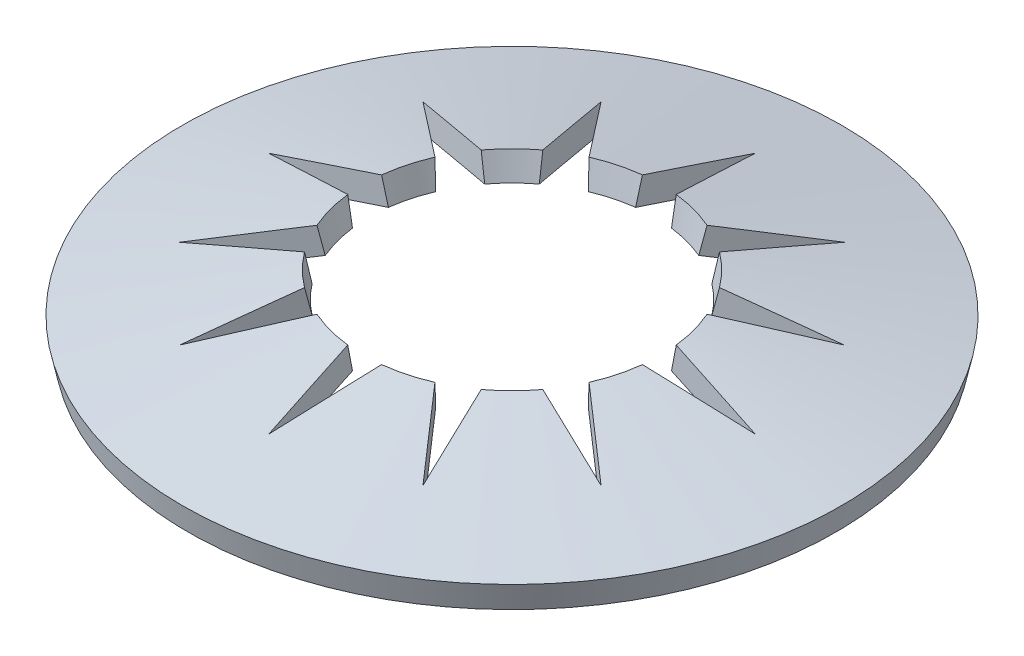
ISO-10303-21;
HEADER;
FILE_DESCRIPTION(('STEP AP214'),'2;1');
FILE_NAME('part.step','',(''),(''),'','','');
FILE_SCHEMA(('AUTOMOTIVE_DESIGN { 1 0 10303 214 1 1 1 1 }'));
ENDSEC;
DATA;
#1=APPLICATION_CONTEXT('core data for automotive mechanical design processes');
#2=APPLICATION_PROTOCOL_DEFINITION('international standard','automotive_design',2000,#1);
#3=PRODUCT_CONTEXT('',#1,'mechanical');
#4=PRODUCT('Part','Part','',(#3));
#5=PRODUCT_RELATED_PRODUCT_CATEGORY('part','',(#4));
#6=PRODUCT_DEFINITION_FORMATION('','',#4);
#7=PRODUCT_DEFINITION_CONTEXT('part definition',#1,'design');
#8=PRODUCT_DEFINITION('design','',#6,#7);
#9=PRODUCT_DEFINITION_SHAPE('','',#8);
#10=(LENGTH_UNIT() NAMED_UNIT(*) SI_UNIT(.MILLI.,.METRE.));
#11=(NAMED_UNIT(*) PLANE_ANGLE_UNIT() SI_UNIT($,.RADIAN.));
#12=(NAMED_UNIT(*) SI_UNIT($,.STERADIAN.) SOLID_ANGLE_UNIT());
#13=UNCERTAINTY_MEASURE_WITH_UNIT(LENGTH_MEASURE(1.E-05),#10,'distance_accuracy_value','');
#14=(GEOMETRIC_REPRESENTATION_CONTEXT(3) GLOBAL_UNCERTAINTY_ASSIGNED_CONTEXT((#13)) GLOBAL_UNIT_ASSIGNED_CONTEXT((#10,
#11,#12)) REPRESENTATION_CONTEXT('',''));
#15=CARTESIAN_POINT('',(0.,0.,0.));
#16=DIRECTION('',(0.,0.,1.));
#17=DIRECTION('',(1.,0.,0.));
#18=AXIS2_PLACEMENT_3D('',#15,#16,#17);
#19=CARTESIAN_POINT('',(0.,0.209193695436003,0.));
#20=DIRECTION('',(0.,1.,0.));
#21=DIRECTION('',(0.,0.,1.));
#22=AXIS2_PLACEMENT_3D('',#19,#20,#21);
#23=CONICAL_SURFACE('',#22,2.16473316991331,0.214815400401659);
#24=CARTESIAN_POINT('',(0.,0.209193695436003,0.));
#25=DIRECTION('',(0.,-1.,0.));
#26=DIRECTION('',(0.,0.,-1.));
#27=AXIS2_PLACEMENT_3D('',#24,#25,#26);
#28=CIRCLE('',#27,2.16473316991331);
#29=CARTESIAN_POINT('',(1.30949882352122,0.209193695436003,-1.72374085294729));
#30=VERTEX_POINT('',#29);
#31=CARTESIAN_POINT('',(1.72374085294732,0.209193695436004,-1.30949882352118));
#32=VERTEX_POINT('',#31);
#33=EDGE_CURVE('E292',#30,#32,#28,.T.);
#34=ORIENTED_EDGE('',*,*,#33,.T.);
#35=CARTESIAN_POINT('',(1.72369792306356,0.208993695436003,-1.30948319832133));
#36=CARTESIAN_POINT('',(1.73769153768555,0.274189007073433,-1.31457645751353));
#37=CARTESIAN_POINT('',(1.75167332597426,0.339387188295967,-1.31966541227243));
#38=CARTESIAN_POINT('',(1.77961324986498,0.469789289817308,-1.32983471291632));
#39=CARTESIAN_POINT('',(1.79357138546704,0.534993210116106,-1.33491505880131));
#40=CARTESIAN_POINT('',(1.80751769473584,0.6002,-1.33999110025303));
#41=B_SPLINE_CURVE_WITH_KNOTS('',3,(#35,#36,#37,#38,#39,#40),.UNSPECIFIED.,.F.,.F.,(4,2,4),(0.,
0.200623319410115,0.40124663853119),.UNSPECIFIED.);
#42=CARTESIAN_POINT('',(1.80747491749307,0.6,-1.33997553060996));
#43=VERTEX_POINT('',#42);
#44=EDGE_CURVE('E278',#32,#43,#41,.T.);
#45=ORIENTED_EDGE('',*,*,#44,.T.);
#46=CARTESIAN_POINT('',(0.,0.6,0.));
#47=DIRECTION('',(0.,-1.,0.));
#48=DIRECTION('',(0.,0.,-1.));
#49=AXIS2_PLACEMENT_3D('',#46,#47,#48);
#50=CIRCLE('',#49,2.25);
#51=CARTESIAN_POINT('',(1.33997553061,0.6,-1.80747491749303));
#52=VERTEX_POINT('',#51);
#53=EDGE_CURVE('E881',#52,#43,#50,.T.);
#54=ORIENTED_EDGE('',*,*,#53,.F.);
#55=CARTESIAN_POINT('',(1.33999110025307,0.6002,-1.80751769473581));
#56=CARTESIAN_POINT('',(1.33491505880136,0.534993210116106,-1.793571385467));
#57=CARTESIAN_POINT('',(1.32983471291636,0.469789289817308,-1.77961324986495));
#58=CARTESIAN_POINT('',(1.31966541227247,0.339387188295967,-1.75167332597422));
#59=CARTESIAN_POINT('',(1.31457645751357,0.274189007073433,-1.73769153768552));
#60=CARTESIAN_POINT('',(1.30948319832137,0.208993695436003,-1.72369792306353));
#61=B_SPLINE_CURVE_WITH_KNOTS('',3,(#55,#56,#57,#58,#59,#60),.UNSPECIFIED.,.F.,.F.,(4,2,4),(0.,
0.200623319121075,0.40124663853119),.UNSPECIFIED.);
#62=EDGE_CURVE('E62',#52,#30,#61,.T.);
#63=ORIENTED_EDGE('',*,*,#62,.T.);
#64=EDGE_LOOP('',(#34,#45,#54,#63));
#65=FACE_BOUND('',#64,.T.);
#66=ADVANCED_FACE('F33',(#65),#23,.F.);
#67=CARTESIAN_POINT('',(0.272188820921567,0.209193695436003,-2.14755277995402));
#68=VERTEX_POINT('',#67);
#69=CARTESIAN_POINT('',(0.838053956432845,0.209193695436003,-1.99592967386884));
#70=VERTEX_POINT('',#69);
#71=EDGE_CURVE('E297',#68,#70,#28,.T.);
#72=ORIENTED_EDGE('',*,*,#71,.T.);
#73=CARTESIAN_POINT('',(0.838024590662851,0.208993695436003,-1.99589467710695));
#74=CARTESIAN_POINT('',(0.847596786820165,0.274189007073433,-2.00730237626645));
#75=CARTESIAN_POINT('',(0.85716089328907,0.339387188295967,-2.01870043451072));
#76=CARTESIAN_POINT('',(0.876272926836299,0.469789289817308,-2.04147726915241));
#77=CARTESIAN_POINT('',(0.885820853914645,0.534993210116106,-2.05285604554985));
#78=CARTESIAN_POINT('',(0.895360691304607,0.6002,-2.06422518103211));
#79=B_SPLINE_CURVE_WITH_KNOTS('',3,(#73,#74,#75,#76,#77,#78),.UNSPECIFIED.,.F.,.F.,(4,2,4),(0.,
0.200623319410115,0.40124663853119),.UNSPECIFIED.);
#80=CARTESIAN_POINT('',(0.895331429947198,0.6,-2.06419030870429));
#81=VERTEX_POINT('',#80);
#82=EDGE_CURVE('E365',#70,#81,#79,.T.);
#83=ORIENTED_EDGE('',*,*,#82,.T.);
#84=CARTESIAN_POINT('',(0.256715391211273,0.6,-2.23530696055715));
#85=VERTEX_POINT('',#84);
#86=EDGE_CURVE('E886',#85,#81,#50,.T.);
#87=ORIENTED_EDGE('',*,*,#86,.F.);
#88=CARTESIAN_POINT('',(0.256707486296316,0.6002,-2.23535179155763));
#89=CARTESIAN_POINT('',(0.259284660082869,0.534993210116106,-2.22073591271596));
#90=CARTESIAN_POINT('',(0.261864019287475,0.469789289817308,-2.20610763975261));
#91=CARTESIAN_POINT('',(0.26702710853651,0.339387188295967,-2.17682630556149));
#92=CARTESIAN_POINT('',(0.269610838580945,0.274189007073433,-2.16217324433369));
#93=CARTESIAN_POINT('',(0.272196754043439,0.208993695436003,-2.14750778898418));
#94=B_SPLINE_CURVE_WITH_KNOTS('',3,(#88,#89,#90,#91,#92,#93),.UNSPECIFIED.,.F.,.F.,(4,2,4),(0.,
0.200623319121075,0.40124663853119),.UNSPECIFIED.);
#95=EDGE_CURVE('E367',#85,#68,#94,.T.);
#96=ORIENTED_EDGE('',*,*,#95,.T.);
#97=EDGE_LOOP('',(#72,#83,#87,#96));
#98=FACE_BOUND('',#97,.T.);
#99=ADVANCED_FACE('F363',(#98),#23,.F.);
#100=CARTESIAN_POINT('',(-0.838053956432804,0.209193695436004,-1.99592967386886));
#101=VERTEX_POINT('',#100);
#102=CARTESIAN_POINT('',(-0.272188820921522,0.209193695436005,-2.14755277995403));
#103=VERTEX_POINT('',#102);
#104=EDGE_CURVE('E348',#101,#103,#28,.T.);
#105=ORIENTED_EDGE('',*,*,#104,.T.);
#106=CARTESIAN_POINT('',(-0.272196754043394,0.208993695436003,-2.14750778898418));
#107=CARTESIAN_POINT('',(-0.2696108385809,0.274189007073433,-2.16217324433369));
#108=CARTESIAN_POINT('',(-0.267027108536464,0.339387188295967,-2.1768263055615));
#109=CARTESIAN_POINT('',(-0.261864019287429,0.469789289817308,-2.20610763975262));
#110=CARTESIAN_POINT('',(-0.259284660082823,0.534993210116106,-2.22073591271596));
#111=CARTESIAN_POINT('',(-0.256707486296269,0.6002,-2.23535179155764));
#112=B_SPLINE_CURVE_WITH_KNOTS('',3,(#106,#107,#108,#109,#110,#111),.UNSPECIFIED.,.F.,.F.,(4,2,
4),(0.,0.200623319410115,0.40124663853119),.UNSPECIFIED.);
#113=CARTESIAN_POINT('',(-0.256715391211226,0.6,-2.23530696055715));
#114=VERTEX_POINT('',#113);
#115=EDGE_CURVE('E576',#103,#114,#112,.T.);
#116=ORIENTED_EDGE('',*,*,#115,.T.);
#117=CARTESIAN_POINT('',(-0.895331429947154,0.6,-2.06419030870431));
#118=VERTEX_POINT('',#117);
#119=EDGE_CURVE('E888',#118,#114,#50,.T.);
#120=ORIENTED_EDGE('',*,*,#119,.F.);
#121=CARTESIAN_POINT('',(-0.895360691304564,0.6002,-2.06422518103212));
#122=CARTESIAN_POINT('',(-0.885820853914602,0.534993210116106,-2.05285604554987));
#123=CARTESIAN_POINT('',(-0.876272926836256,0.469789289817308,-2.04147726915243));
#124=CARTESIAN_POINT('',(-0.857160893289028,0.339387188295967,-2.01870043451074));
#125=CARTESIAN_POINT('',(-0.847596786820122,0.274189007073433,-2.00730237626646));
#126=CARTESIAN_POINT('',(-0.838024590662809,0.208993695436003,-1.99589467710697));
#127=B_SPLINE_CURVE_WITH_KNOTS('',3,(#121,#122,#123,#124,#125,#126),.UNSPECIFIED.,.F.,.F.,(4,2,
4),(0.,0.200623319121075,0.40124663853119),.UNSPECIFIED.);
#128=EDGE_CURVE('E592',#118,#101,#127,.T.);
#129=ORIENTED_EDGE('',*,*,#128,.T.);
#130=EDGE_LOOP('',(#105,#116,#120,#129));
#131=FACE_BOUND('',#130,.T.);
#132=ADVANCED_FACE('F946',(#131),#23,.F.);
#133=CARTESIAN_POINT('',(-1.7237408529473,0.209193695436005,-1.30949882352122));
#134=VERTEX_POINT('',#133);
#135=CARTESIAN_POINT('',(-1.30949882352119,0.209193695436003,-1.72374085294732));
#136=VERTEX_POINT('',#135);
#137=EDGE_CURVE('E342',#134,#136,#28,.T.);
#138=ORIENTED_EDGE('',*,*,#137,.T.);
#139=CARTESIAN_POINT('',(-1.30948319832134,0.208993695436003,-1.72369792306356));
#140=CARTESIAN_POINT('',(-1.31457645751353,0.274189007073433,-1.73769153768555));
#141=CARTESIAN_POINT('',(-1.31966541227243,0.339387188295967,-1.75167332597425));
#142=CARTESIAN_POINT('',(-1.32983471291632,0.469789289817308,-1.77961324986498));
#143=CARTESIAN_POINT('',(-1.33491505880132,0.534993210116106,-1.79357138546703));
#144=CARTESIAN_POINT('',(-1.33999110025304,0.6002,-1.80751769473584));
#145=B_SPLINE_CURVE_WITH_KNOTS('',3,(#139,#140,#141,#142,#143,#144),.UNSPECIFIED.,.F.,.F.,(4,2,
4),(0.,0.200623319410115,0.40124663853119),.UNSPECIFIED.);
#146=CARTESIAN_POINT('',(-1.33997553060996,0.6,-1.80747491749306));
#147=VERTEX_POINT('',#146);
#148=EDGE_CURVE('E602',#136,#147,#145,.T.);
#149=ORIENTED_EDGE('',*,*,#148,.T.);
#150=CARTESIAN_POINT('',(-1.80747491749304,0.6,-1.33997553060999));
#151=VERTEX_POINT('',#150);
#152=EDGE_CURVE('E891',#151,#147,#50,.T.);
#153=ORIENTED_EDGE('',*,*,#152,.F.);
#154=CARTESIAN_POINT('',(-1.80751769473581,0.6002,-1.33999110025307));
#155=CARTESIAN_POINT('',(-1.79357138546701,0.534993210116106,-1.33491505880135));
#156=CARTESIAN_POINT('',(-1.77961324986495,0.469789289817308,-1.32983471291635));
#157=CARTESIAN_POINT('',(-1.75167332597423,0.339387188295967,-1.31966541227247));
#158=CARTESIAN_POINT('',(-1.73769153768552,0.274189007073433,-1.31457645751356));
#159=CARTESIAN_POINT('',(-1.72369792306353,0.208993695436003,-1.30948319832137));
#160=B_SPLINE_CURVE_WITH_KNOTS('',3,(#154,#155,#156,#157,#158,#159),.UNSPECIFIED.,.F.,.F.,(4,2,
4),(0.,0.200623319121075,0.40124663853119),.UNSPECIFIED.);
#161=EDGE_CURVE('E628',#151,#134,#160,.T.);
#162=ORIENTED_EDGE('',*,*,#161,.T.);
#163=EDGE_LOOP('',(#138,#149,#153,#162));
#164=FACE_BOUND('',#163,.T.);
#165=ADVANCED_FACE('F948',(#164),#23,.F.);
#166=CARTESIAN_POINT('',(-2.14755277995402,0.209193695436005,-0.272188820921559));
#167=VERTEX_POINT('',#166);
#168=CARTESIAN_POINT('',(-1.99592967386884,0.209193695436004,-0.838053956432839));
#169=VERTEX_POINT('',#168);
#170=EDGE_CURVE('E336',#167,#169,#28,.T.);
#171=ORIENTED_EDGE('',*,*,#170,.T.);
#172=CARTESIAN_POINT('',(-1.99589467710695,0.208993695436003,-0.838024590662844));
#173=CARTESIAN_POINT('',(-2.00730237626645,0.274189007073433,-0.847596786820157));
#174=CARTESIAN_POINT('',(-2.01870043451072,0.339387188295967,-0.857160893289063));
#175=CARTESIAN_POINT('',(-2.04147726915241,0.469789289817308,-0.876272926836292));
#176=CARTESIAN_POINT('',(-2.05285604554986,0.534993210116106,-0.885820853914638));
#177=CARTESIAN_POINT('',(-2.06422518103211,0.6002,-0.8953606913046));
#178=B_SPLINE_CURVE_WITH_KNOTS('',3,(#172,#173,#174,#175,#176,#177),.UNSPECIFIED.,.F.,.F.,(4,2,
4),(0.,0.200623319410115,0.40124663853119),.UNSPECIFIED.);
#179=CARTESIAN_POINT('',(-2.06419030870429,0.6,-0.89533142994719));
#180=VERTEX_POINT('',#179);
#181=EDGE_CURVE('E638',#169,#180,#178,.T.);
#182=ORIENTED_EDGE('',*,*,#181,.T.);
#183=CARTESIAN_POINT('',(-2.23530696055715,0.6,-0.256715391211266));
#184=VERTEX_POINT('',#183);
#185=EDGE_CURVE('E895',#184,#180,#50,.T.);
#186=ORIENTED_EDGE('',*,*,#185,.F.);
#187=CARTESIAN_POINT('',(-2.23535179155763,0.6002,-0.256707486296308));
#188=CARTESIAN_POINT('',(-2.22073591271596,0.534993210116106,-0.259284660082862));
#189=CARTESIAN_POINT('',(-2.20610763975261,0.469789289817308,-0.261864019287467));
#190=CARTESIAN_POINT('',(-2.17682630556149,0.339387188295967,-0.267027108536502));
#191=CARTESIAN_POINT('',(-2.16217324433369,0.274189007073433,-0.269610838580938));
#192=CARTESIAN_POINT('',(-2.14750778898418,0.208993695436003,-0.272196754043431));
#193=B_SPLINE_CURVE_WITH_KNOTS('',3,(#187,#188,#189,#190,#191,#192),.UNSPECIFIED.,.F.,.F.,(4,2,
4),(0.,0.200623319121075,0.40124663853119),.UNSPECIFIED.);
#194=EDGE_CURVE('E651',#184,#167,#193,.T.);
#195=ORIENTED_EDGE('',*,*,#194,.T.);
#196=EDGE_LOOP('',(#171,#182,#186,#195));
#197=FACE_BOUND('',#196,.T.);
#198=ADVANCED_FACE('F953',(#197),#23,.F.);
#199=CARTESIAN_POINT('',(-1.99592967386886,0.209193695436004,0.838053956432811));
#200=VERTEX_POINT('',#199);
#201=CARTESIAN_POINT('',(-2.14755277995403,0.209193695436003,0.272188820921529));
#202=VERTEX_POINT('',#201);
#203=EDGE_CURVE('E330',#200,#202,#28,.T.);
#204=ORIENTED_EDGE('',*,*,#203,.T.);
#205=CARTESIAN_POINT('',(-2.14750778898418,0.208993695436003,0.272196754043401));
#206=CARTESIAN_POINT('',(-2.16217324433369,0.274189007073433,0.269610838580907));
#207=CARTESIAN_POINT('',(-2.1768263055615,0.339387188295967,0.267027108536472));
#208=CARTESIAN_POINT('',(-2.20610763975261,0.469789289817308,0.261864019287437));
#209=CARTESIAN_POINT('',(-2.22073591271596,0.534993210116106,0.259284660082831));
#210=CARTESIAN_POINT('',(-2.23535179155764,0.6002,0.256707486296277));
#211=B_SPLINE_CURVE_WITH_KNOTS('',3,(#205,#206,#207,#208,#209,#210),.UNSPECIFIED.,.F.,.F.,(4,2,
4),(0.,0.200623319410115,0.40124663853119),.UNSPECIFIED.);
#212=CARTESIAN_POINT('',(-2.23530696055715,0.6,0.256715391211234));
#213=VERTEX_POINT('',#212);
#214=EDGE_CURVE('E676',#202,#213,#211,.T.);
#215=ORIENTED_EDGE('',*,*,#214,.T.);
#216=CARTESIAN_POINT('',(-2.0641903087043,0.6,0.895331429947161));
#217=VERTEX_POINT('',#216);
#218=EDGE_CURVE('E900',#217,#213,#50,.T.);
#219=ORIENTED_EDGE('',*,*,#218,.F.);
#220=CARTESIAN_POINT('',(-2.06422518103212,0.6002,0.895360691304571));
#221=CARTESIAN_POINT('',(-2.05285604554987,0.534993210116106,0.885820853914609));
#222=CARTESIAN_POINT('',(-2.04147726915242,0.469789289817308,0.876272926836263));
#223=CARTESIAN_POINT('',(-2.01870043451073,0.339387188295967,0.857160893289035));
#224=CARTESIAN_POINT('',(-2.00730237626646,0.274189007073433,0.847596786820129));
#225=CARTESIAN_POINT('',(-1.99589467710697,0.208993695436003,0.838024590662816));
#226=B_SPLINE_CURVE_WITH_KNOTS('',3,(#220,#221,#222,#223,#224,#225),.UNSPECIFIED.,.F.,.F.,(4,2,
4),(0.,0.200623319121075,0.40124663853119),.UNSPECIFIED.);
#227=EDGE_CURVE('E688',#217,#200,#226,.T.);
#228=ORIENTED_EDGE('',*,*,#227,.T.);
#229=EDGE_LOOP('',(#204,#215,#219,#228));
#230=FACE_BOUND('',#229,.T.);
#231=ADVANCED_FACE('F978',(#230),#23,.F.);
#232=CARTESIAN_POINT('',(-1.30949882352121,0.209193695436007,1.7237408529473));
#233=VERTEX_POINT('',#232);
#234=CARTESIAN_POINT('',(-1.72374085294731,0.209193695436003,1.30949882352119));
#235=VERTEX_POINT('',#234);
#236=EDGE_CURVE('E324',#233,#235,#28,.T.);
#237=ORIENTED_EDGE('',*,*,#236,.T.);
#238=CARTESIAN_POINT('',(-1.72369792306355,0.208993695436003,1.30948319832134));
#239=CARTESIAN_POINT('',(-1.73769153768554,0.274189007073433,1.31457645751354));
#240=CARTESIAN_POINT('',(-1.75167332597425,0.339387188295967,1.31966541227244));
#241=CARTESIAN_POINT('',(-1.77961324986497,0.469789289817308,1.32983471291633));
#242=CARTESIAN_POINT('',(-1.79357138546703,0.534993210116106,1.33491505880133));
#243=CARTESIAN_POINT('',(-1.80751769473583,0.6002,1.33999110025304));
#244=B_SPLINE_CURVE_WITH_KNOTS('',3,(#238,#239,#240,#241,#242,#243),.UNSPECIFIED.,.F.,.F.,(4,2,
4),(0.,0.200623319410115,0.40124663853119),.UNSPECIFIED.);
#245=CARTESIAN_POINT('',(-1.80747491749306,0.6,1.33997553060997));
#246=VERTEX_POINT('',#245);
#247=EDGE_CURVE('E698',#235,#246,#244,.T.);
#248=ORIENTED_EDGE('',*,*,#247,.T.);
#249=CARTESIAN_POINT('',(-1.33997553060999,0.6,1.80747491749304));
#250=VERTEX_POINT('',#249);
#251=EDGE_CURVE('E905',#250,#246,#50,.T.);
#252=ORIENTED_EDGE('',*,*,#251,.F.);
#253=CARTESIAN_POINT('',(-1.33999110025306,0.6002,1.80751769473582));
#254=CARTESIAN_POINT('',(-1.33491505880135,0.534993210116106,1.79357138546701));
#255=CARTESIAN_POINT('',(-1.32983471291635,0.469789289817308,1.77961324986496));
#256=CARTESIAN_POINT('',(-1.31966541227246,0.339387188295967,1.75167332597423));
#257=CARTESIAN_POINT('',(-1.31457645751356,0.274189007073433,1.73769153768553));
#258=CARTESIAN_POINT('',(-1.30948319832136,0.208993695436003,1.72369792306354));
#259=B_SPLINE_CURVE_WITH_KNOTS('',3,(#253,#254,#255,#256,#257,#258),.UNSPECIFIED.,.F.,.F.,(4,2,
4),(0.,0.200623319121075,0.40124663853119),.UNSPECIFIED.);
#260=EDGE_CURVE('E724',#250,#233,#259,.T.);
#261=ORIENTED_EDGE('',*,*,#260,.T.);
#262=EDGE_LOOP('',(#237,#248,#252,#261));
#263=FACE_BOUND('',#262,.T.);
#264=ADVANCED_FACE('F974',(#263),#23,.F.);
#265=CARTESIAN_POINT('',(-0.272188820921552,0.209193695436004,2.14755277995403));
#266=VERTEX_POINT('',#265);
#267=CARTESIAN_POINT('',(-0.838053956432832,0.209193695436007,1.99592967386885));
#268=VERTEX_POINT('',#267);
#269=EDGE_CURVE('E318',#266,#268,#28,.T.);
#270=ORIENTED_EDGE('',*,*,#269,.T.);
#271=CARTESIAN_POINT('',(-0.838024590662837,0.208993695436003,1.99589467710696));
#272=CARTESIAN_POINT('',(-0.84759678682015,0.274189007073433,2.00730237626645));
#273=CARTESIAN_POINT('',(-0.857160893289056,0.339387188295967,2.01870043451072));
#274=CARTESIAN_POINT('',(-0.876272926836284,0.469789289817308,2.04147726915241));
#275=CARTESIAN_POINT('',(-0.885820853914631,0.534993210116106,2.05285604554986));
#276=CARTESIAN_POINT('',(-0.895360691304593,0.6002,2.06422518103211));
#277=B_SPLINE_CURVE_WITH_KNOTS('',3,(#271,#272,#273,#274,#275,#276),.UNSPECIFIED.,.F.,.F.,(4,2,
4),(0.,0.200623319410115,0.40124663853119),.UNSPECIFIED.);
#278=CARTESIAN_POINT('',(-0.895331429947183,0.6,2.06419030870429));
#279=VERTEX_POINT('',#278);
#280=EDGE_CURVE('E734',#268,#279,#277,.T.);
#281=ORIENTED_EDGE('',*,*,#280,.T.);
#282=CARTESIAN_POINT('',(-0.256715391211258,0.6,2.23530696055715));
#283=VERTEX_POINT('',#282);
#284=EDGE_CURVE('E910',#283,#279,#50,.T.);
#285=ORIENTED_EDGE('',*,*,#284,.F.);
#286=CARTESIAN_POINT('',(-0.2567074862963,0.6002,2.23535179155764));
#287=CARTESIAN_POINT('',(-0.259284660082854,0.534993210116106,2.22073591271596));
#288=CARTESIAN_POINT('',(-0.26186401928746,0.469789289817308,2.20610763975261));
#289=CARTESIAN_POINT('',(-0.267027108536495,0.339387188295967,2.1768263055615));
#290=CARTESIAN_POINT('',(-0.26961083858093,0.274189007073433,2.16217324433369));
#291=CARTESIAN_POINT('',(-0.272196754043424,0.208993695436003,2.14750778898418));
#292=B_SPLINE_CURVE_WITH_KNOTS('',3,(#286,#287,#288,#289,#290,#291),.UNSPECIFIED.,.F.,.F.,(4,2,
4),(0.,0.200623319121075,0.40124663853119),.UNSPECIFIED.);
#293=EDGE_CURVE('E747',#283,#266,#292,.T.);
#294=ORIENTED_EDGE('',*,*,#293,.T.);
#295=EDGE_LOOP('',(#270,#281,#285,#294));
#296=FACE_BOUND('',#295,.T.);
#297=ADVANCED_FACE('F970',(#296),#23,.F.);
#298=CARTESIAN_POINT('',(0.838053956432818,0.209193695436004,1.99592967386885));
#299=VERTEX_POINT('',#298);
#300=CARTESIAN_POINT('',(0.272188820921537,0.209193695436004,2.14755277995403));
#301=VERTEX_POINT('',#300);
#302=EDGE_CURVE('E312',#299,#301,#28,.T.);
#303=ORIENTED_EDGE('',*,*,#302,.T.);
#304=CARTESIAN_POINT('',(0.272196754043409,0.208993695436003,2.14750778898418));
#305=CARTESIAN_POINT('',(0.269610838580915,0.274189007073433,2.16217324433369));
#306=CARTESIAN_POINT('',(0.267027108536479,0.339387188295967,2.1768263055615));
#307=CARTESIAN_POINT('',(0.261864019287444,0.469789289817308,2.20610763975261));
#308=CARTESIAN_POINT('',(0.259284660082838,0.534993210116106,2.22073591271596));
#309=CARTESIAN_POINT('',(0.256707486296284,0.6002,2.23535179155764));
#310=B_SPLINE_CURVE_WITH_KNOTS('',3,(#304,#305,#306,#307,#308,#309),.UNSPECIFIED.,.F.,.F.,(4,2,
4),(0.,0.200623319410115,0.40124663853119),.UNSPECIFIED.);
#311=CARTESIAN_POINT('',(0.256715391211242,0.6,2.23530696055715));
#312=VERTEX_POINT('',#311);
#313=EDGE_CURVE('E772',#301,#312,#310,.T.);
#314=ORIENTED_EDGE('',*,*,#313,.T.);
#315=CARTESIAN_POINT('',(0.895331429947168,0.6,2.0641903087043));
#316=VERTEX_POINT('',#315);
#317=EDGE_CURVE('E915',#316,#312,#50,.T.);
#318=ORIENTED_EDGE('',*,*,#317,.F.);
#319=CARTESIAN_POINT('',(0.895360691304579,0.6002,2.06422518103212));
#320=CARTESIAN_POINT('',(0.885820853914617,0.534993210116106,2.05285604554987));
#321=CARTESIAN_POINT('',(0.87627292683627,0.469789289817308,2.04147726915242));
#322=CARTESIAN_POINT('',(0.857160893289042,0.339387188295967,2.01870043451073));
#323=CARTESIAN_POINT('',(0.847596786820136,0.274189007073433,2.00730237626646));
#324=CARTESIAN_POINT('',(0.838024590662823,0.208993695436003,1.99589467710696));
#325=B_SPLINE_CURVE_WITH_KNOTS('',3,(#319,#320,#321,#322,#323,#324),.UNSPECIFIED.,.F.,.F.,(4,2,
4),(0.,0.200623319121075,0.40124663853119),.UNSPECIFIED.);
#326=EDGE_CURVE('E784',#316,#299,#325,.T.);
#327=ORIENTED_EDGE('',*,*,#326,.T.);
#328=EDGE_LOOP('',(#303,#314,#318,#327));
#329=FACE_BOUND('',#328,.T.);
#330=ADVANCED_FACE('F966',(#329),#23,.F.);
#331=CARTESIAN_POINT('',(1.72374085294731,0.209193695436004,1.30949882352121));
#332=VERTEX_POINT('',#331);
#333=CARTESIAN_POINT('',(1.3094988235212,0.209193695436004,1.72374085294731));
#334=VERTEX_POINT('',#333);
#335=EDGE_CURVE('E304',#332,#334,#28,.T.);
#336=ORIENTED_EDGE('',*,*,#335,.T.);
#337=CARTESIAN_POINT('',(1.30948319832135,0.208993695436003,1.72369792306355));
#338=CARTESIAN_POINT('',(1.31457645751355,0.274189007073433,1.73769153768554));
#339=CARTESIAN_POINT('',(1.31966541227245,0.339387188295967,1.75167332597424));
#340=CARTESIAN_POINT('',(1.32983471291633,0.469789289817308,1.77961324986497));
#341=CARTESIAN_POINT('',(1.33491505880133,0.534993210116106,1.79357138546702));
#342=CARTESIAN_POINT('',(1.33999110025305,0.6002,1.80751769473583));
#343=B_SPLINE_CURVE_WITH_KNOTS('',3,(#337,#338,#339,#340,#341,#342),.UNSPECIFIED.,.F.,.F.,(4,2,
4),(0.,0.200623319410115,0.40124663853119),.UNSPECIFIED.);
#344=CARTESIAN_POINT('',(1.33997553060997,0.6,1.80747491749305));
#345=VERTEX_POINT('',#344);
#346=EDGE_CURVE('E794',#334,#345,#343,.T.);
#347=ORIENTED_EDGE('',*,*,#346,.T.);
#348=CARTESIAN_POINT('',(1.80747491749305,0.6,1.33997553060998));
#349=VERTEX_POINT('',#348);
#350=EDGE_CURVE('E299',#349,#345,#50,.T.);
#351=ORIENTED_EDGE('',*,*,#350,.F.);
#352=CARTESIAN_POINT('',(1.80751769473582,0.6002,1.33999110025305));
#353=CARTESIAN_POINT('',(1.79357138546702,0.534993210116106,1.33491505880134));
#354=CARTESIAN_POINT('',(1.77961324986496,0.469789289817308,1.32983471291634));
#355=CARTESIAN_POINT('',(1.75167332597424,0.339387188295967,1.31966541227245));
#356=CARTESIAN_POINT('',(1.73769153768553,0.274189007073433,1.31457645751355));
#357=CARTESIAN_POINT('',(1.72369792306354,0.208993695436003,1.30948319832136));
#358=B_SPLINE_CURVE_WITH_KNOTS('',3,(#352,#353,#354,#355,#356,#357),.UNSPECIFIED.,.F.,.F.,(4,2,
4),(0.,0.200623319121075,0.40124663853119),.UNSPECIFIED.);
#359=EDGE_CURVE('E820',#349,#332,#358,.T.);
#360=ORIENTED_EDGE('',*,*,#359,.T.);
#361=EDGE_LOOP('',(#336,#347,#351,#360));
#362=FACE_BOUND('',#361,.T.);
#363=ADVANCED_FACE('F928',(#362),#23,.F.);
#364=CARTESIAN_POINT('',(2.14755277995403,0.209193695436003,0.272188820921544));
#365=VERTEX_POINT('',#364);
#366=CARTESIAN_POINT('',(1.99592967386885,0.209193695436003,0.838053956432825));
#367=VERTEX_POINT('',#366);
#368=EDGE_CURVE('E295',#365,#367,#28,.T.);
#369=ORIENTED_EDGE('',*,*,#368,.T.);
#370=CARTESIAN_POINT('',(1.99589467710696,0.208993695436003,0.83802459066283));
#371=CARTESIAN_POINT('',(2.00730237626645,0.274189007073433,0.847596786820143));
#372=CARTESIAN_POINT('',(2.01870043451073,0.339387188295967,0.857160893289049));
#373=CARTESIAN_POINT('',(2.04147726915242,0.469789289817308,0.876272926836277));
#374=CARTESIAN_POINT('',(2.05285604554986,0.534993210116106,0.885820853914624));
#375=CARTESIAN_POINT('',(2.06422518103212,0.6002,0.895360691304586));
#376=B_SPLINE_CURVE_WITH_KNOTS('',3,(#370,#371,#372,#373,#374,#375),.UNSPECIFIED.,.F.,.F.,(4,2,
4),(0.,0.200623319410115,0.40124663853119),.UNSPECIFIED.);
#377=CARTESIAN_POINT('',(2.0641903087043,0.6,0.895331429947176));
#378=VERTEX_POINT('',#377);
#379=EDGE_CURVE('E830',#367,#378,#376,.T.);
#380=ORIENTED_EDGE('',*,*,#379,.T.);
#381=CARTESIAN_POINT('',(2.23530696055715,0.6,0.25671539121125));
#382=VERTEX_POINT('',#381);
#383=EDGE_CURVE('E293',#382,#378,#50,.T.);
#384=ORIENTED_EDGE('',*,*,#383,.F.);
#385=CARTESIAN_POINT('',(2.23535179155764,0.6002,0.256707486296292));
#386=CARTESIAN_POINT('',(2.22073591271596,0.534993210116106,0.259284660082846));
#387=CARTESIAN_POINT('',(2.20610763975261,0.469789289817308,0.261864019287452));
#388=CARTESIAN_POINT('',(2.1768263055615,0.339387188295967,0.267027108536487));
#389=CARTESIAN_POINT('',(2.16217324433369,0.274189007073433,0.269610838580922));
#390=CARTESIAN_POINT('',(2.14750778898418,0.208993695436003,0.272196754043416));
#391=B_SPLINE_CURVE_WITH_KNOTS('',3,(#385,#386,#387,#388,#389,#390),.UNSPECIFIED.,.F.,.F.,(4,2,
4),(0.,0.200623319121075,0.40124663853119),.UNSPECIFIED.);
#392=EDGE_CURVE('E843',#382,#365,#391,.T.);
#393=ORIENTED_EDGE('',*,*,#392,.T.);
#394=EDGE_LOOP('',(#369,#380,#384,#393));
#395=FACE_BOUND('',#394,.T.);
#396=ADVANCED_FACE('F938',(#395),#23,.F.);
#397=CARTESIAN_POINT('',(0.,0.209193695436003,0.));
#398=DIRECTION('',(0.,-1.,0.));
#399=DIRECTION('',(0.,0.,-1.));
#400=AXIS2_PLACEMENT_3D('',#397,#398,#399);
#401=CONICAL_SURFACE('',#400,2.16473316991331,1.35598092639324);
#402=CARTESIAN_POINT('',(1.72354085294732,0.209238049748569,-1.30942602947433));
#403=CARTESIAN_POINT('',(1.84641836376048,0.181973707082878,-1.35414978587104));
#404=CARTESIAN_POINT('',(1.96925854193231,0.154520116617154,-1.39885995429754));
#405=CARTESIAN_POINT('',(2.21488434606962,0.0993391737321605,-1.48826043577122));
#406=CARTESIAN_POINT('',(2.33766997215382,0.0716118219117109,-1.5329507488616));
#407=CARTESIAN_POINT('',(2.58320713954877,0.0159880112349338,-1.6223189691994));
#408=CARTESIAN_POINT('',(2.70595868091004,-0.0119084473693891,-1.6669968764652));
#409=CARTESIAN_POINT('',(2.95143728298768,-0.0678244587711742,-1.75634378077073));
#410=CARTESIAN_POINT('',(3.07416434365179,-0.0958440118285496,-1.80101277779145));
#411=CARTESIAN_POINT('',(3.19688361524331,-0.123902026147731,-1.84567893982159));
#412=B_SPLINE_CURVE_WITH_KNOTS('',3,(#402,#403,#404,#405,#406,#407,#408,#409,#410,#411),
.UNSPECIFIED.,.F.,.F.,(4,2,2,2,4),(0.,0.400726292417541,0.801451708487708,1.20217652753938,
1.60290219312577),.UNSPECIFIED.);
#413=CARTESIAN_POINT('',(3.19668361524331,-0.123856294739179,-1.84560614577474));
#414=VERTEX_POINT('',#413);
#415=EDGE_CURVE('E1204',#32,#414,#412,.T.);
#416=ORIENTED_EDGE('',*,*,#415,.F.);
#417=ORIENTED_EDGE('',*,*,#33,.F.);
#418=CARTESIAN_POINT('',(1.84567893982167,-0.123902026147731,-3.19688361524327));
#419=CARTESIAN_POINT('',(1.80101277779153,-0.0958440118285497,-3.07416434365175));
#420=CARTESIAN_POINT('',(1.7563437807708,-0.0678244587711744,-2.95143728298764));
#421=CARTESIAN_POINT('',(1.66699687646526,-0.0119084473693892,-2.70595868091));
#422=CARTESIAN_POINT('',(1.62231896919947,0.0159880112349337,-2.58320713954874));
#423=CARTESIAN_POINT('',(1.53295074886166,0.0716118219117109,-2.33766997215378));
#424=CARTESIAN_POINT('',(1.48826043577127,0.0993391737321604,-2.21488434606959));
#425=CARTESIAN_POINT('',(1.39885995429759,0.154520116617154,-1.96925854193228));
#426=CARTESIAN_POINT('',(1.35414978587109,0.181973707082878,-1.84641836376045));
#427=CARTESIAN_POINT('',(1.30942602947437,0.209238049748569,-1.72354085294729));
#428=B_SPLINE_CURVE_WITH_KNOTS('',3,(#418,#419,#420,#421,#422,#423,#424,#425,#426,#427),
.UNSPECIFIED.,.F.,.F.,(4,2,2,2,4),(0.,0.40072566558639,0.801450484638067,1.20217590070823,
1.60290219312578),.UNSPECIFIED.);
#429=CARTESIAN_POINT('',(1.84560614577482,-0.123856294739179,-3.19668361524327));
#430=VERTEX_POINT('',#429);
#431=EDGE_CURVE('E375',#430,#30,#428,.T.);
#432=ORIENTED_EDGE('',*,*,#431,.F.);
#433=CARTESIAN_POINT('',(0.83788613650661,0.209248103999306,-1.99572967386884));
#434=CARTESIAN_POINT('',(0.921944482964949,0.181982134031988,-2.09590651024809));
#435=CARTESIAN_POINT('',(1.0059772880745,0.154526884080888,-2.19605290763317));
#436=CARTESIAN_POINT('',(1.17400557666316,0.0993425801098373,-2.39630122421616));
#437=CARTESIAN_POINT('',(1.2580010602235,0.0716135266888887,-2.49640314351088));
#438=CARTESIAN_POINT('',(1.42596870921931,0.0159862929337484,-2.69657919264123));
#439=CARTESIAN_POINT('',(1.50994087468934,-0.0119118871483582,-2.79665332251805));
#440=CARTESIAN_POINT('',(1.6778684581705,-0.067831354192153,-2.99678162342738));
#441=CARTESIAN_POINT('',(1.76182387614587,-0.0958526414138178,-3.09683579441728));
#442=CARTESIAN_POINT('',(1.84577396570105,-0.123912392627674,-3.19688361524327));
#443=B_SPLINE_CURVE_WITH_KNOTS('',3,(#433,#434,#435,#436,#437,#438,#439,#440,#441,#442),
.UNSPECIFIED.,.F.,.F.,(4,2,2,2,4),(0.,0.400750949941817,0.801501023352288,1.20225049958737,
1.60300082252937),.UNSPECIFIED.);
#444=EDGE_CURVE('E373',#70,#430,#443,.T.);
#445=ORIENTED_EDGE('',*,*,#444,.F.);
#446=ORIENTED_EDGE('',*,*,#71,.F.);
#447=CARTESIAN_POINT('',(-3.52653961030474E-05,-0.123899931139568,-3.69141229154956));
#448=CARTESIAN_POINT('',(0.0226420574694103,-0.0958422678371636,-3.56280280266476));
#449=CARTESIAN_POINT('',(0.0453208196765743,-0.0678230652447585,-3.43418515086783));
#450=CARTESIAN_POINT('',(0.0906828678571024,-0.0119077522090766,-3.17692419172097));
#451=CARTESIAN_POINT('',(0.113366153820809,0.0159883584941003,-3.0482808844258));
#452=CARTESIAN_POINT('',(0.158739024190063,0.071611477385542,-2.79095854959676));
#453=CARTESIAN_POINT('',(0.181428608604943,0.0993384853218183,-2.66227952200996));
#454=CARTESIAN_POINT('',(0.226817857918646,0.154518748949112,-2.40486429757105));
#455=CARTESIAN_POINT('',(0.249517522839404,0.181972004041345,-2.27612810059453));
#456=CARTESIAN_POINT('',(0.272224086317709,0.209236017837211,-2.14735277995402));
#457=B_SPLINE_CURVE_WITH_KNOTS('',3,(#447,#448,#449,#450,#451,#452,#453,#454,#455,#456),
.UNSPECIFIED.,.F.,.F.,(4,2,2,2,4),(0.,0.400720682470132,0.801440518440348,1.20216095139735,
1.60288226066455),.UNSPECIFIED.);
#458=CARTESIAN_POINT('',(0.,-0.123856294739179,-3.69121229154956));
#459=VERTEX_POINT('',#458);
#460=EDGE_CURVE('E371',#459,#68,#457,.T.);
#461=ORIENTED_EDGE('',*,*,#460,.F.);
#462=CARTESIAN_POINT('',(-0.272224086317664,0.209236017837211,-2.14735277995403));
#463=CARTESIAN_POINT('',(-0.249517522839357,0.181972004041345,-2.27612810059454));
#464=CARTESIAN_POINT('',(-0.226817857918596,0.154518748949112,-2.40486429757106));
#465=CARTESIAN_POINT('',(-0.181428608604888,0.0993384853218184,-2.66227952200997));
#466=CARTESIAN_POINT('',(-0.158739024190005,0.0716114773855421,-2.79095854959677));
#467=CARTESIAN_POINT('',(-0.113366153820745,0.0159883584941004,-3.0482808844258));
#468=CARTESIAN_POINT('',(-0.090682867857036,-0.0119077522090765,-3.17692419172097));
#469=CARTESIAN_POINT('',(-0.0453208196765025,-0.0678230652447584,-3.43418515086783));
#470=CARTESIAN_POINT('',(-0.0226420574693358,-0.0958422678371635,-3.56280280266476));
#471=CARTESIAN_POINT('',(3.52653961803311E-05,-0.123899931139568,-3.69141229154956));
#472=B_SPLINE_CURVE_WITH_KNOTS('',3,(#462,#463,#464,#465,#466,#467,#468,#469,#470,#471),
.UNSPECIFIED.,.F.,.F.,(4,2,2,2,4),(0.,0.4007213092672,0.801441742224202,1.20216157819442,
1.60288226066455),.UNSPECIFIED.);
#473=EDGE_CURVE('E581',#103,#459,#472,.T.);
#474=ORIENTED_EDGE('',*,*,#473,.F.);
#475=ORIENTED_EDGE('',*,*,#104,.F.);
#476=CARTESIAN_POINT('',(-1.84577396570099,-0.123912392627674,-3.19688361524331));
#477=CARTESIAN_POINT('',(-1.76182387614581,-0.0958526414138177,-3.09683579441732));
#478=CARTESIAN_POINT('',(-1.67786845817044,-0.0678313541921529,-2.99678162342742));
#479=CARTESIAN_POINT('',(-1.50994087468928,-0.0119118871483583,-2.79665332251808));
#480=CARTESIAN_POINT('',(-1.42596870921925,0.0159862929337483,-2.69657919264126));
#481=CARTESIAN_POINT('',(-1.25800106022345,0.0716135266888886,-2.4964031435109));
#482=CARTESIAN_POINT('',(-1.17400557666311,0.0993425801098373,-2.39630122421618));
#483=CARTESIAN_POINT('',(-1.00597728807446,0.154526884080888,-2.19605290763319));
#484=CARTESIAN_POINT('',(-0.921944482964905,0.181982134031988,-2.09590651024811));
#485=CARTESIAN_POINT('',(-0.837886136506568,0.209248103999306,-1.99572967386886));
#486=B_SPLINE_CURVE_WITH_KNOTS('',3,(#476,#477,#478,#479,#480,#481,#482,#483,#484,#485),
.UNSPECIFIED.,.F.,.F.,(4,2,2,2,4),(0.,0.400750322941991,0.801499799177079,1.20224987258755,
1.60300082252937),.UNSPECIFIED.);
#487=CARTESIAN_POINT('',(-1.84560614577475,-0.123856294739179,-3.19668361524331));
#488=VERTEX_POINT('',#487);
#489=EDGE_CURVE('E597',#488,#101,#486,.T.);
#490=ORIENTED_EDGE('',*,*,#489,.F.);
#491=CARTESIAN_POINT('',(-1.30942602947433,0.209238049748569,-1.72354085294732));
#492=CARTESIAN_POINT('',(-1.35414978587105,0.181973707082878,-1.84641836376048));
#493=CARTESIAN_POINT('',(-1.39885995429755,0.154520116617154,-1.96925854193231));
#494=CARTESIAN_POINT('',(-1.48826043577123,0.0993391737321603,-2.21488434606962));
#495=CARTESIAN_POINT('',(-1.53295074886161,0.0716118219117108,-2.33766997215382));
#496=CARTESIAN_POINT('',(-1.62231896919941,0.0159880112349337,-2.58320713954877));
#497=CARTESIAN_POINT('',(-1.66699687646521,-0.0119084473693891,-2.70595868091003));
#498=CARTESIAN_POINT('',(-1.75634378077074,-0.0678244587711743,-2.95143728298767));
#499=CARTESIAN_POINT('',(-1.80101277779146,-0.0958440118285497,-3.07416434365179));
#500=CARTESIAN_POINT('',(-1.8456789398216,-0.123902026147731,-3.19688361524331));
#501=B_SPLINE_CURVE_WITH_KNOTS('',3,(#491,#492,#493,#494,#495,#496,#497,#498,#499,#500),
.UNSPECIFIED.,.F.,.F.,(4,2,2,2,4),(0.,0.400726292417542,0.801451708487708,1.20217652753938,
1.60290219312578),.UNSPECIFIED.);
#502=EDGE_CURVE('E607',#136,#488,#501,.T.);
#503=ORIENTED_EDGE('',*,*,#502,.F.);
#504=ORIENTED_EDGE('',*,*,#137,.F.);
#505=CARTESIAN_POINT('',(-3.19688361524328,-0.123902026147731,-1.84567893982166));
#506=CARTESIAN_POINT('',(-3.07416434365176,-0.0958440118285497,-1.80101277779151));
#507=CARTESIAN_POINT('',(-2.95143728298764,-0.0678244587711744,-1.75634378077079));
#508=CARTESIAN_POINT('',(-2.70595868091,-0.0119084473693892,-1.66699687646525));
#509=CARTESIAN_POINT('',(-2.58320713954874,0.0159880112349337,-1.62231896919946));
#510=CARTESIAN_POINT('',(-2.33766997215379,0.0716118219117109,-1.53295074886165));
#511=CARTESIAN_POINT('',(-2.21488434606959,0.0993391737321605,-1.48826043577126));
#512=CARTESIAN_POINT('',(-1.96925854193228,0.154520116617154,-1.39885995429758));
#513=CARTESIAN_POINT('',(-1.84641836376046,0.181973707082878,-1.35414978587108));
#514=CARTESIAN_POINT('',(-1.7235408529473,0.209238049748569,-1.30942602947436));
#515=B_SPLINE_CURVE_WITH_KNOTS('',3,(#505,#506,#507,#508,#509,#510,#511,#512,#513,#514),
.UNSPECIFIED.,.F.,.F.,(4,2,2,2,4),(0.,0.40072566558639,0.801450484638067,1.20217590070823,
1.60290219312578),.UNSPECIFIED.);
#516=CARTESIAN_POINT('',(-3.19668361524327,-0.123856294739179,-1.84560614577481));
#517=VERTEX_POINT('',#516);
#518=EDGE_CURVE('E632',#517,#134,#515,.T.);
#519=ORIENTED_EDGE('',*,*,#518,.F.);
#520=CARTESIAN_POINT('',(-1.99572967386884,0.209248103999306,-0.837886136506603));
#521=CARTESIAN_POINT('',(-2.0959065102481,0.181982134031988,-0.921944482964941));
#522=CARTESIAN_POINT('',(-2.19605290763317,0.154526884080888,-1.00597728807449));
#523=CARTESIAN_POINT('',(-2.39630122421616,0.0993425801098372,-1.17400557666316));
#524=CARTESIAN_POINT('',(-2.49640314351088,0.0716135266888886,-1.25800106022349));
#525=CARTESIAN_POINT('',(-2.69657919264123,0.0159862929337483,-1.4259687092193));
#526=CARTESIAN_POINT('',(-2.79665332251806,-0.0119118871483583,-1.50994087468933));
#527=CARTESIAN_POINT('',(-2.99678162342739,-0.0678313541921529,-1.67786845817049));
#528=CARTESIAN_POINT('',(-3.09683579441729,-0.0958526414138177,-1.76182387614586));
#529=CARTESIAN_POINT('',(-3.19688361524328,-0.123912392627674,-1.84577396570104));
#530=B_SPLINE_CURVE_WITH_KNOTS('',3,(#520,#521,#522,#523,#524,#525,#526,#527,#528,#529),
.UNSPECIFIED.,.F.,.F.,(4,2,2,2,4),(0.,0.400750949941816,0.801501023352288,1.20225049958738,
1.60300082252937),.UNSPECIFIED.);
#531=EDGE_CURVE('E643',#169,#517,#530,.T.);
#532=ORIENTED_EDGE('',*,*,#531,.F.);
#533=ORIENTED_EDGE('',*,*,#170,.F.);
#534=CARTESIAN_POINT('',(-3.69141229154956,-0.123899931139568,3.5265396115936E-05));
#535=CARTESIAN_POINT('',(-3.56280280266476,-0.0958422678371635,-0.0226420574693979));
#536=CARTESIAN_POINT('',(-3.43418515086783,-0.0678230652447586,-0.0453208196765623));
#537=CARTESIAN_POINT('',(-3.17692419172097,-0.0119077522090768,-0.0906828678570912));
#538=CARTESIAN_POINT('',(-3.0482808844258,0.0159883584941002,-0.113366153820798));
#539=CARTESIAN_POINT('',(-2.79095854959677,0.071611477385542,-0.158739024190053));
#540=CARTESIAN_POINT('',(-2.66227952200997,0.0993384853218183,-0.181428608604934));
#541=CARTESIAN_POINT('',(-2.40486429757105,0.154518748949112,-0.226817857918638));
#542=CARTESIAN_POINT('',(-2.27612810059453,0.181972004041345,-0.249517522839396));
#543=CARTESIAN_POINT('',(-2.14735277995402,0.209236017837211,-0.272224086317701));
#544=B_SPLINE_CURVE_WITH_KNOTS('',3,(#534,#535,#536,#537,#538,#539,#540,#541,#542,#543),
.UNSPECIFIED.,.F.,.F.,(4,2,2,2,4),(0.,0.400720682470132,0.801440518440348,1.20216095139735,
1.60288226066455),.UNSPECIFIED.);
#545=CARTESIAN_POINT('',(-3.69121229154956,-0.123856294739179,0.));
#546=VERTEX_POINT('',#545);
#547=EDGE_CURVE('E656',#546,#167,#544,.T.);
#548=ORIENTED_EDGE('',*,*,#547,.F.);
#549=CARTESIAN_POINT('',(-2.14735277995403,0.209236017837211,0.272224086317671));
#550=CARTESIAN_POINT('',(-2.27612810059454,0.181972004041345,0.249517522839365));
#551=CARTESIAN_POINT('',(-2.40486429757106,0.154518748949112,0.226817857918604));
#552=CARTESIAN_POINT('',(-2.66227952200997,0.0993384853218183,0.181428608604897));
#553=CARTESIAN_POINT('',(-2.79095854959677,0.071611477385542,0.158739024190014));
#554=CARTESIAN_POINT('',(-3.0482808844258,0.0159883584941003,0.113366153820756));
#555=CARTESIAN_POINT('',(-3.17692419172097,-0.0119077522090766,0.090682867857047));
#556=CARTESIAN_POINT('',(-3.43418515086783,-0.0678230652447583,0.0453208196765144));
#557=CARTESIAN_POINT('',(-3.56280280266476,-0.0958422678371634,0.0226420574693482));
#558=CARTESIAN_POINT('',(-3.69141229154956,-0.123899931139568,-3.52653961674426E-05));
#559=B_SPLINE_CURVE_WITH_KNOTS('',3,(#549,#550,#551,#552,#553,#554,#555,#556,#557,#558),
.UNSPECIFIED.,.F.,.F.,(4,2,2,2,4),(0.,0.4007213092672,0.801441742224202,1.20216157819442,
1.60288226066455),.UNSPECIFIED.);
#560=EDGE_CURVE('E680',#202,#546,#559,.T.);
#561=ORIENTED_EDGE('',*,*,#560,.F.);
#562=ORIENTED_EDGE('',*,*,#203,.F.);
#563=CARTESIAN_POINT('',(-3.1968836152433,-0.123912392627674,1.845773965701));
#564=CARTESIAN_POINT('',(-3.09683579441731,-0.0958526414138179,1.76182387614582));
#565=CARTESIAN_POINT('',(-2.99678162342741,-0.0678313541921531,1.67786845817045));
#566=CARTESIAN_POINT('',(-2.79665332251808,-0.0119118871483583,1.50994087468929));
#567=CARTESIAN_POINT('',(-2.69657919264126,0.0159862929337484,1.42596870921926));
#568=CARTESIAN_POINT('',(-2.4964031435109,0.0716135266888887,1.25800106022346));
#569=CARTESIAN_POINT('',(-2.39630122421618,0.0993425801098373,1.17400557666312));
#570=CARTESIAN_POINT('',(-2.19605290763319,0.154526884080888,1.00597728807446));
#571=CARTESIAN_POINT('',(-2.09590651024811,0.181982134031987,0.921944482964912));
#572=CARTESIAN_POINT('',(-1.99572967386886,0.209248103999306,0.837886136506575));
#573=B_SPLINE_CURVE_WITH_KNOTS('',3,(#563,#564,#565,#566,#567,#568,#569,#570,#571,#572),
.UNSPECIFIED.,.F.,.F.,(4,2,2,2,4),(0.,0.400750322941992,0.801499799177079,1.20224987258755,
1.60300082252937),.UNSPECIFIED.);
#574=CARTESIAN_POINT('',(-3.1966836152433,-0.123856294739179,1.84560614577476));
#575=VERTEX_POINT('',#574);
#576=EDGE_CURVE('E693',#575,#200,#573,.T.);
#577=ORIENTED_EDGE('',*,*,#576,.F.);
#578=CARTESIAN_POINT('',(-1.72354085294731,0.209238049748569,1.30942602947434));
#579=CARTESIAN_POINT('',(-1.84641836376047,0.181973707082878,1.35414978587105));
#580=CARTESIAN_POINT('',(-1.9692585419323,0.154520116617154,1.39885995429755));
#581=CARTESIAN_POINT('',(-2.21488434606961,0.0993391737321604,1.48826043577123));
#582=CARTESIAN_POINT('',(-2.33766997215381,0.0716118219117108,1.53295074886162));
#583=CARTESIAN_POINT('',(-2.58320713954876,0.0159880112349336,1.62231896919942));
#584=CARTESIAN_POINT('',(-2.70595868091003,-0.0119084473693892,1.66699687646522));
#585=CARTESIAN_POINT('',(-2.95143728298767,-0.0678244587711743,1.75634378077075));
#586=CARTESIAN_POINT('',(-3.07416434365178,-0.0958440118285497,1.80101277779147));
#587=CARTESIAN_POINT('',(-3.1968836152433,-0.123902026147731,1.84567893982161));
#588=B_SPLINE_CURVE_WITH_KNOTS('',3,(#578,#579,#580,#581,#582,#583,#584,#585,#586,#587),
.UNSPECIFIED.,.F.,.F.,(4,2,2,2,4),(0.,0.400726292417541,0.801451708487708,1.20217652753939,
1.60290219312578),.UNSPECIFIED.);
#589=EDGE_CURVE('E703',#235,#575,#588,.T.);
#590=ORIENTED_EDGE('',*,*,#589,.F.);
#591=ORIENTED_EDGE('',*,*,#236,.F.);
#592=CARTESIAN_POINT('',(-1.84567893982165,-0.123902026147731,3.19688361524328));
#593=CARTESIAN_POINT('',(-1.8010127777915,-0.0958440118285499,3.07416434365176));
#594=CARTESIAN_POINT('',(-1.75634378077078,-0.0678244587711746,2.95143728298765));
#595=CARTESIAN_POINT('',(-1.66699687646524,-0.0119084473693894,2.70595868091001));
#596=CARTESIAN_POINT('',(-1.62231896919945,0.0159880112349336,2.58320713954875));
#597=CARTESIAN_POINT('',(-1.53295074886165,0.0716118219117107,2.33766997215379));
#598=CARTESIAN_POINT('',(-1.48826043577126,0.0993391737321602,2.2148843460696));
#599=CARTESIAN_POINT('',(-1.39885995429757,0.154520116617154,1.96925854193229));
#600=CARTESIAN_POINT('',(-1.35414978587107,0.181973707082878,1.84641836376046));
#601=CARTESIAN_POINT('',(-1.30942602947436,0.209238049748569,1.7235408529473));
#602=B_SPLINE_CURVE_WITH_KNOTS('',3,(#592,#593,#594,#595,#596,#597,#598,#599,#600,#601),
.UNSPECIFIED.,.F.,.F.,(4,2,2,2,4),(0.,0.40072566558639,0.801450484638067,1.20217590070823,
1.60290219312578),.UNSPECIFIED.);
#603=CARTESIAN_POINT('',(-1.84560614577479,-0.123856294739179,3.19668361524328));
#604=VERTEX_POINT('',#603);
#605=EDGE_CURVE('E728',#604,#233,#602,.T.);
#606=ORIENTED_EDGE('',*,*,#605,.F.);
#607=CARTESIAN_POINT('',(-0.837886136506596,0.209248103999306,1.99572967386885));
#608=CARTESIAN_POINT('',(-0.921944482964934,0.181982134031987,2.0959065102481));
#609=CARTESIAN_POINT('',(-1.00597728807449,0.154526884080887,2.19605290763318));
#610=CARTESIAN_POINT('',(-1.17400557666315,0.0993425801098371,2.39630122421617));
#611=CARTESIAN_POINT('',(-1.25800106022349,0.0716135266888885,2.49640314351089));
#612=CARTESIAN_POINT('',(-1.42596870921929,0.0159862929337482,2.69657919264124));
#613=CARTESIAN_POINT('',(-1.50994087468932,-0.0119118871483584,2.79665332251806));
#614=CARTESIAN_POINT('',(-1.67786845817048,-0.0678313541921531,2.9967816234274));
#615=CARTESIAN_POINT('',(-1.76182387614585,-0.095852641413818,3.0968357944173));
#616=CARTESIAN_POINT('',(-1.84577396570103,-0.123912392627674,3.19688361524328));
#617=B_SPLINE_CURVE_WITH_KNOTS('',3,(#607,#608,#609,#610,#611,#612,#613,#614,#615,#616),
.UNSPECIFIED.,.F.,.F.,(4,2,2,2,4),(0.,0.400750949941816,0.801501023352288,1.20225049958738,
1.60300082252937),.UNSPECIFIED.);
#618=EDGE_CURVE('E739',#268,#604,#617,.T.);
#619=ORIENTED_EDGE('',*,*,#618,.F.);
#620=ORIENTED_EDGE('',*,*,#269,.F.);
#621=CARTESIAN_POINT('',(3.52653961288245E-05,-0.123899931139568,3.69141229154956));
#622=CARTESIAN_POINT('',(-0.0226420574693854,-0.0958422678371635,3.56280280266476));
#623=CARTESIAN_POINT('',(-0.0453208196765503,-0.0678230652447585,3.43418515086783));
#624=CARTESIAN_POINT('',(-0.0906828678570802,-0.0119077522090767,3.17692419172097));
#625=CARTESIAN_POINT('',(-0.113366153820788,0.0159883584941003,3.0482808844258));
#626=CARTESIAN_POINT('',(-0.158739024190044,0.071611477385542,2.79095854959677));
#627=CARTESIAN_POINT('',(-0.181428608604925,0.0993384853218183,2.66227952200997));
#628=CARTESIAN_POINT('',(-0.226817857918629,0.154518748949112,2.40486429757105));
#629=CARTESIAN_POINT('',(-0.249517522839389,0.181972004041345,2.27612810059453));
#630=CARTESIAN_POINT('',(-0.272224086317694,0.209236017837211,2.14735277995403));
#631=B_SPLINE_CURVE_WITH_KNOTS('',3,(#621,#622,#623,#624,#625,#626,#627,#628,#629,#630),
.UNSPECIFIED.,.F.,.F.,(4,2,2,2,4),(0.,0.400720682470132,0.801440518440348,1.20216095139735,
1.60288226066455),.UNSPECIFIED.);
#632=CARTESIAN_POINT('',(0.,-0.123856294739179,3.69121229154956));
#633=VERTEX_POINT('',#632);
#634=EDGE_CURVE('E752',#633,#266,#631,.T.);
#635=ORIENTED_EDGE('',*,*,#634,.F.);
#636=CARTESIAN_POINT('',(0.272224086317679,0.209236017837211,2.14735277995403));
#637=CARTESIAN_POINT('',(0.249517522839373,0.181972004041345,2.27612810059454));
#638=CARTESIAN_POINT('',(0.226817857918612,0.154518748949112,2.40486429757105));
#639=CARTESIAN_POINT('',(0.181428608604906,0.0993384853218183,2.66227952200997));
#640=CARTESIAN_POINT('',(0.158739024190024,0.071611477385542,2.79095854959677));
#641=CARTESIAN_POINT('',(0.113366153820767,0.0159883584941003,3.0482808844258));
#642=CARTESIAN_POINT('',(0.0906828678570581,-0.0119077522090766,3.17692419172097));
#643=CARTESIAN_POINT('',(0.0453208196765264,-0.0678230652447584,3.43418515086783));
#644=CARTESIAN_POINT('',(0.0226420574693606,-0.0958422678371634,3.56280280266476));
#645=CARTESIAN_POINT('',(-3.52653961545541E-05,-0.123899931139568,3.69141229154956));
#646=B_SPLINE_CURVE_WITH_KNOTS('',3,(#636,#637,#638,#639,#640,#641,#642,#643,#644,#645),
.UNSPECIFIED.,.F.,.F.,(4,2,2,2,4),(0.,0.4007213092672,0.801441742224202,1.20216157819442,
1.60288226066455),.UNSPECIFIED.);
#647=EDGE_CURVE('E776',#301,#633,#646,.T.);
#648=ORIENTED_EDGE('',*,*,#647,.F.);
#649=ORIENTED_EDGE('',*,*,#302,.F.);
#650=CARTESIAN_POINT('',(1.84577396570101,-0.123912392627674,3.19688361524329));
#651=CARTESIAN_POINT('',(1.76182387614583,-0.0958526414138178,3.09683579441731));
#652=CARTESIAN_POINT('',(1.67786845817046,-0.067831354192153,2.99678162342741));
#653=CARTESIAN_POINT('',(1.5099408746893,-0.0119118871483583,2.79665332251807));
#654=CARTESIAN_POINT('',(1.42596870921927,0.0159862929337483,2.69657919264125));
#655=CARTESIAN_POINT('',(1.25800106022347,0.0716135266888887,2.4964031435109));
#656=CARTESIAN_POINT('',(1.17400557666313,0.0993425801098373,2.39630122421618));
#657=CARTESIAN_POINT('',(1.00597728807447,0.154526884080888,2.19605290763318));
#658=CARTESIAN_POINT('',(0.921944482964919,0.181982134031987,2.09590651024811));
#659=CARTESIAN_POINT('',(0.837886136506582,0.209248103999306,1.99572967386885));
#660=B_SPLINE_CURVE_WITH_KNOTS('',3,(#650,#651,#652,#653,#654,#655,#656,#657,#658,#659),
.UNSPECIFIED.,.F.,.F.,(4,2,2,2,4),(0.,0.400750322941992,0.801499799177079,1.20224987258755,
1.60300082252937),.UNSPECIFIED.);
#661=CARTESIAN_POINT('',(1.84560614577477,-0.123856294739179,3.19668361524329));
#662=VERTEX_POINT('',#661);
#663=EDGE_CURVE('E789',#662,#299,#660,.T.);
#664=ORIENTED_EDGE('',*,*,#663,.F.);
#665=CARTESIAN_POINT('',(1.30942602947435,0.209238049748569,1.72354085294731));
#666=CARTESIAN_POINT('',(1.35414978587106,0.181973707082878,1.84641836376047));
#667=CARTESIAN_POINT('',(1.39885995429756,0.154520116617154,1.9692585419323));
#668=CARTESIAN_POINT('',(1.48826043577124,0.0993391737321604,2.21488434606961));
#669=CARTESIAN_POINT('',(1.53295074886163,0.0716118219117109,2.3376699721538));
#670=CARTESIAN_POINT('',(1.62231896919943,0.0159880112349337,2.58320713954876));
#671=CARTESIAN_POINT('',(1.66699687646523,-0.0119084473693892,2.70595868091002));
#672=CARTESIAN_POINT('',(1.75634378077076,-0.0678244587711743,2.95143728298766));
#673=CARTESIAN_POINT('',(1.80101277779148,-0.0958440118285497,3.07416434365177));
#674=CARTESIAN_POINT('',(1.84567893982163,-0.123902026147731,3.19688361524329));
#675=B_SPLINE_CURVE_WITH_KNOTS('',3,(#665,#666,#667,#668,#669,#670,#671,#672,#673,#674),
.UNSPECIFIED.,.F.,.F.,(4,2,2,2,4),(0.,0.400726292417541,0.801451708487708,1.20217652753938,
1.60290219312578),.UNSPECIFIED.);
#676=EDGE_CURVE('E799',#334,#662,#675,.T.);
#677=ORIENTED_EDGE('',*,*,#676,.F.);
#678=ORIENTED_EDGE('',*,*,#335,.F.);
#679=CARTESIAN_POINT('',(3.19688361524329,-0.123902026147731,1.84567893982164));
#680=CARTESIAN_POINT('',(3.07416434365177,-0.0958440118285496,1.80101277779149));
#681=CARTESIAN_POINT('',(2.95143728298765,-0.0678244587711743,1.75634378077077));
#682=CARTESIAN_POINT('',(2.70595868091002,-0.0119084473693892,1.66699687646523));
#683=CARTESIAN_POINT('',(2.58320713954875,0.0159880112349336,1.62231896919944));
#684=CARTESIAN_POINT('',(2.3376699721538,0.0716118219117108,1.53295074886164));
#685=CARTESIAN_POINT('',(2.2148843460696,0.0993391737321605,1.48826043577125));
#686=CARTESIAN_POINT('',(1.96925854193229,0.154520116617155,1.39885995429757));
#687=CARTESIAN_POINT('',(1.84641836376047,0.181973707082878,1.35414978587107));
#688=CARTESIAN_POINT('',(1.72354085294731,0.209238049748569,1.30942602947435));
#689=B_SPLINE_CURVE_WITH_KNOTS('',3,(#679,#680,#681,#682,#683,#684,#685,#686,#687,#688),
.UNSPECIFIED.,.F.,.F.,(4,2,2,2,4),(0.,0.40072566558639,0.801450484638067,1.20217590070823,
1.60290219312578),.UNSPECIFIED.);
#690=CARTESIAN_POINT('',(3.19668361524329,-0.123856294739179,1.84560614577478));
#691=VERTEX_POINT('',#690);
#692=EDGE_CURVE('E824',#691,#332,#689,.T.);
#693=ORIENTED_EDGE('',*,*,#692,.F.);
#694=CARTESIAN_POINT('',(1.99572967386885,0.209248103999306,0.837886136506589));
#695=CARTESIAN_POINT('',(2.0959065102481,0.181982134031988,0.921944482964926));
#696=CARTESIAN_POINT('',(2.19605290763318,0.154526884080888,1.00597728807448));
#697=CARTESIAN_POINT('',(2.39630122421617,0.0993425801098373,1.17400557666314));
#698=CARTESIAN_POINT('',(2.49640314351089,0.0716135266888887,1.25800106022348));
#699=CARTESIAN_POINT('',(2.69657919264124,0.0159862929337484,1.42596870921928));
#700=CARTESIAN_POINT('',(2.79665332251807,-0.0119118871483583,1.50994087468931));
#701=CARTESIAN_POINT('',(2.9967816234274,-0.067831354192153,1.67786845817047));
#702=CARTESIAN_POINT('',(3.0968357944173,-0.0958526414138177,1.76182387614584));
#703=CARTESIAN_POINT('',(3.19688361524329,-0.123912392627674,1.84577396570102));
#704=B_SPLINE_CURVE_WITH_KNOTS('',3,(#694,#695,#696,#697,#698,#699,#700,#701,#702,#703),
.UNSPECIFIED.,.F.,.F.,(4,2,2,2,4),(0.,0.400750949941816,0.801501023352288,1.20225049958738,
1.60300082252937),.UNSPECIFIED.);
#705=EDGE_CURVE('E835',#367,#691,#704,.T.);
#706=ORIENTED_EDGE('',*,*,#705,.F.);
#707=ORIENTED_EDGE('',*,*,#368,.F.);
#708=CARTESIAN_POINT('',(3.69141229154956,-0.123899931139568,-3.5265396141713E-05));
#709=CARTESIAN_POINT('',(3.56280280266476,-0.0958422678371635,0.022642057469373));
#710=CARTESIAN_POINT('',(3.43418515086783,-0.0678230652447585,0.0453208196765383));
#711=CARTESIAN_POINT('',(3.17692419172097,-0.0119077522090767,0.0906828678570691));
#712=CARTESIAN_POINT('',(3.0482808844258,0.0159883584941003,0.113366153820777));
#713=CARTESIAN_POINT('',(2.79095854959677,0.071611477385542,0.158739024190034));
#714=CARTESIAN_POINT('',(2.66227952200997,0.0993384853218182,0.181428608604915));
#715=CARTESIAN_POINT('',(2.40486429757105,0.154518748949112,0.226817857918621));
#716=CARTESIAN_POINT('',(2.27612810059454,0.181972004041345,0.24951752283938));
#717=CARTESIAN_POINT('',(2.14735277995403,0.209236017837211,0.272224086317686));
#718=B_SPLINE_CURVE_WITH_KNOTS('',3,(#708,#709,#710,#711,#712,#713,#714,#715,#716,#717),
.UNSPECIFIED.,.F.,.F.,(4,2,2,2,4),(0.,0.400720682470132,0.801440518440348,1.20216095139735,
1.60288226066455),.UNSPECIFIED.);
#719=CARTESIAN_POINT('',(3.69121229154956,-0.123856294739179,0.));
#720=VERTEX_POINT('',#719);
#721=EDGE_CURVE('E848',#720,#365,#718,.T.);
#722=ORIENTED_EDGE('',*,*,#721,.F.);
#723=CARTESIAN_POINT('',(2.14735277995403,0.209236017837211,-0.272224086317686));
#724=CARTESIAN_POINT('',(2.27612810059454,0.181972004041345,-0.249517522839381));
#725=CARTESIAN_POINT('',(2.40486429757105,0.154518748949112,-0.226817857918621));
#726=CARTESIAN_POINT('',(2.66227952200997,0.0993384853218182,-0.181428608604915));
#727=CARTESIAN_POINT('',(2.79095854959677,0.071611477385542,-0.158739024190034));
#728=CARTESIAN_POINT('',(3.0482808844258,0.0159883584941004,-0.113366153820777));
#729=CARTESIAN_POINT('',(3.17692419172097,-0.0119077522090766,-0.0906828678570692));
#730=CARTESIAN_POINT('',(3.43418515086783,-0.0678230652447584,-0.0453208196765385));
#731=CARTESIAN_POINT('',(3.56280280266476,-0.0958422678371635,-0.0226420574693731));
#732=CARTESIAN_POINT('',(3.69141229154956,-0.123899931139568,3.52653961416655E-05));
#733=B_SPLINE_CURVE_WITH_KNOTS('',3,(#723,#724,#725,#726,#727,#728,#729,#730,#731,#732),
.UNSPECIFIED.,.F.,.F.,(4,2,2,2,4),(0.,0.400721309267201,0.801441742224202,1.20216157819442,
1.60288226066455),.UNSPECIFIED.);
#734=CARTESIAN_POINT('',(2.14755277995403,0.209193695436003,-0.272188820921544));
#735=VERTEX_POINT('',#734);
#736=EDGE_CURVE('E291',#735,#720,#733,.T.);
#737=ORIENTED_EDGE('',*,*,#736,.F.);
#738=CARTESIAN_POINT('',(1.99592967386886,0.209193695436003,-0.838053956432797));
#739=VERTEX_POINT('',#738);
#740=EDGE_CURVE('E284',#739,#735,#28,.T.);
#741=ORIENTED_EDGE('',*,*,#740,.F.);
#742=CARTESIAN_POINT('',(3.19688361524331,-0.123912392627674,-1.84577396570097));
#743=CARTESIAN_POINT('',(3.09683579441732,-0.0958526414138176,-1.7618238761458));
#744=CARTESIAN_POINT('',(2.99678162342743,-0.0678313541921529,-1.67786845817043));
#745=CARTESIAN_POINT('',(2.79665332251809,-0.0119118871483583,-1.50994087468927));
#746=CARTESIAN_POINT('',(2.69657919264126,0.0159862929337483,-1.42596870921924));
#747=CARTESIAN_POINT('',(2.49640314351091,0.0716135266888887,-1.25800106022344));
#748=CARTESIAN_POINT('',(2.39630122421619,0.0993425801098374,-1.17400557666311));
#749=CARTESIAN_POINT('',(2.19605290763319,0.154526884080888,-1.00597728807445));
#750=CARTESIAN_POINT('',(2.09590651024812,0.181982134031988,-0.921944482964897));
#751=CARTESIAN_POINT('',(1.99572967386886,0.209248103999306,-0.837886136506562));
#752=B_SPLINE_CURVE_WITH_KNOTS('',3,(#742,#743,#744,#745,#746,#747,#748,#749,#750,#751),
.UNSPECIFIED.,.F.,.F.,(4,2,2,2,4),(0.,0.400750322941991,0.801499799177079,1.20224987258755,
1.60300082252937),.UNSPECIFIED.);
#753=EDGE_CURVE('E271',#414,#739,#752,.T.);
#754=ORIENTED_EDGE('',*,*,#753,.F.);
#755=EDGE_LOOP('',(#416,#417,#432,#445,#446,#461,#474,#475,#490,#503,#504,#519,#532,#533,#548,
#561,#562,#577,#590,#591,#606,#619,#620,#635,#648,#649,#664,#677,#678,#693,#706,#707,#722,#737,
#741,#754));
#756=FACE_BOUND('',#755,.T.);
#757=CARTESIAN_POINT('',(0.,-0.390806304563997,0.));
#758=DIRECTION('',(0.,-1.,0.));
#759=DIRECTION('',(0.,0.,-1.));
#760=AXIS2_PLACEMENT_3D('',#757,#758,#759);
#761=CIRCLE('',#760,4.91473316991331);
#762=CARTESIAN_POINT('',(0.,-0.390806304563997,-4.91473316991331));
#763=VERTEX_POINT('',#762);
#764=EDGE_CURVE('E874',#763,#763,#761,.T.);
#765=ORIENTED_EDGE('',*,*,#764,.T.);
#766=EDGE_LOOP('',(#765));
#767=FACE_BOUND('',#766,.T.);
#768=ADVANCED_FACE('F35',(#756,#767),#401,.F.);
#769=CARTESIAN_POINT('',(2.06419030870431,0.6,-0.895331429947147));
#770=VERTEX_POINT('',#769);
#771=CARTESIAN_POINT('',(2.23530696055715,0.6,-0.25671539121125));
#772=VERTEX_POINT('',#771);
#773=EDGE_CURVE('E286',#770,#772,#50,.T.);
#774=ORIENTED_EDGE('',*,*,#773,.F.);
#775=CARTESIAN_POINT('',(2.06422518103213,0.6002,-0.895360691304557));
#776=CARTESIAN_POINT('',(2.05285604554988,0.534993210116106,-0.885820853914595));
#777=CARTESIAN_POINT('',(2.04147726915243,0.469789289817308,-0.876272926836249));
#778=CARTESIAN_POINT('',(2.01870043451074,0.339387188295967,-0.857160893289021));
#779=CARTESIAN_POINT('',(2.00730237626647,0.274189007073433,-0.847596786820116));
#780=CARTESIAN_POINT('',(1.99589467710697,0.208993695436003,-0.838024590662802));
#781=B_SPLINE_CURVE_WITH_KNOTS('',3,(#775,#776,#777,#778,#779,#780),.UNSPECIFIED.,.F.,.F.,(4,2,
4),(0.,0.200623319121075,0.40124663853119),.UNSPECIFIED.);
#782=EDGE_CURVE('E54',#770,#739,#781,.T.);
#783=ORIENTED_EDGE('',*,*,#782,.T.);
#784=ORIENTED_EDGE('',*,*,#740,.T.);
#785=CARTESIAN_POINT('',(2.14750778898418,0.208993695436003,-0.272196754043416));
#786=CARTESIAN_POINT('',(2.16217324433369,0.274189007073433,-0.269610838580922));
#787=CARTESIAN_POINT('',(2.1768263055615,0.339387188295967,-0.267027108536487));
#788=CARTESIAN_POINT('',(2.20610763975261,0.469789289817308,-0.261864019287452));
#789=CARTESIAN_POINT('',(2.22073591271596,0.534993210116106,-0.259284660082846));
#790=CARTESIAN_POINT('',(2.23535179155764,0.6002,-0.256707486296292));
#791=B_SPLINE_CURVE_WITH_KNOTS('',3,(#785,#786,#787,#788,#789,#790),.UNSPECIFIED.,.F.,.F.,(4,2,
4),(0.,0.200623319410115,0.40124663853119),.UNSPECIFIED.);
#792=EDGE_CURVE('E866',#735,#772,#791,.T.);
#793=ORIENTED_EDGE('',*,*,#792,.T.);
#794=EDGE_LOOP('',(#774,#783,#784,#793));
#795=FACE_BOUND('',#794,.T.);
#796=ADVANCED_FACE('F282',(#795),#23,.F.);
#797=CARTESIAN_POINT('',(0.,0.6,0.));
#798=DIRECTION('',(0.,-1.,0.));
#799=DIRECTION('',(0.,0.,-1.));
#800=AXIS2_PLACEMENT_3D('',#797,#798,#799);
#801=CONICAL_SURFACE('',#800,2.25,1.35598092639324);
#802=CARTESIAN_POINT('',(0.,0.,0.));
#803=DIRECTION('',(0.,-1.,0.));
#804=DIRECTION('',(0.,0.,-1.));
#805=AXIS2_PLACEMENT_3D('',#802,#803,#804);
#806=CIRCLE('',#805,5.);
#807=CARTESIAN_POINT('',(0.,0.,-5.));
#808=VERTEX_POINT('',#807);
#809=EDGE_CURVE('E877',#808,#808,#806,.T.);
#810=ORIENTED_EDGE('',*,*,#809,.F.);
#811=EDGE_LOOP('',(#810));
#812=FACE_BOUND('',#811,.T.);
#813=ORIENTED_EDGE('',*,*,#53,.T.);
#814=CARTESIAN_POINT('',(1.8065762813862,0.6002,-1.33964845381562));
#815=CARTESIAN_POINT('',(1.92251720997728,0.574387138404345,-1.38184750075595));
#816=CARTESIAN_POINT('',(2.03842789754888,0.548421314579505,-1.42403554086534));
#817=CARTESIAN_POINT('',(2.27020429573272,0.49626425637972,-1.50839525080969));
#818=CARTESIAN_POINT('',(2.38607000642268,0.470073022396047,-1.55056692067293));
#819=CARTESIAN_POINT('',(2.61777222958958,0.417545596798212,-1.63489963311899));
#820=CARTESIAN_POINT('',(2.73360874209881,0.391209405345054,-1.67706067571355));
#821=CARTESIAN_POINT('',(2.96526038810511,0.338429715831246,-1.76137497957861));
#822=CARTESIAN_POINT('',(3.08107552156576,0.311986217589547,-1.80352824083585));
#823=CARTESIAN_POINT('',(3.19688361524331,0.28550795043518,-1.84567893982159));
#824=B_SPLINE_CURVE_WITH_KNOTS('',3,(#814,#815,#816,#817,#818,#819,#820,#821,#822,#823),
.UNSPECIFIED.,.F.,.F.,(4,2,2,2,4),(0.,0.378158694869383,0.756316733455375,1.13447435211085,
1.51263260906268),.UNSPECIFIED.);
#825=CARTESIAN_POINT('',(3.19668361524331,0.285553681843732,-1.84560614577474));
#826=VERTEX_POINT('',#825);
#827=EDGE_CURVE('E11',#43,#826,#824,.T.);
#828=ORIENTED_EDGE('',*,*,#827,.T.);
#829=CARTESIAN_POINT('',(3.19688361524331,0.285497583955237,-1.84577396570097));
#830=CARTESIAN_POINT('',(3.10247291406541,0.311976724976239,-1.76655398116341));
#831=CARTESIAN_POINT('',(3.00805647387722,0.338421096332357,-1.68732918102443));
#832=CARTESIAN_POINT('',(2.81920616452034,0.391202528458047,-1.52886495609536));
#833=CARTESIAN_POINT('',(2.72477229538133,0.417539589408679,-1.44962553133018));
#834=CARTESIAN_POINT('',(2.53588075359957,0.470068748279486,-1.29112670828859));
#835=CARTESIAN_POINT('',(2.44142308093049,0.496260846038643,-1.21186730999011));
#836=CARTESIAN_POINT('',(2.25247106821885,0.548419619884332,-1.05331774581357));
#837=CARTESIAN_POINT('',(2.15797672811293,0.574386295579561,-0.974027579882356));
#838=CARTESIAN_POINT('',(2.06345773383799,0.6002,-0.894716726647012));
#839=B_SPLINE_CURVE_WITH_KNOTS('',3,(#829,#830,#831,#832,#833,#834,#835,#836,#837,#838),
.UNSPECIFIED.,.F.,.F.,(4,2,2,2,4),(0.,0.378170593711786,0.756340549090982,1.13451092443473,
1.51268195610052),.UNSPECIFIED.);
#840=EDGE_CURVE('E47',#826,#770,#839,.T.);
#841=ORIENTED_EDGE('',*,*,#840,.T.);
#842=ORIENTED_EDGE('',*,*,#773,.T.);
#843=CARTESIAN_POINT('',(2.23436518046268,0.6002,-0.256881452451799));
#844=CARTESIAN_POINT('',(2.3558716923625,0.574387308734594,-0.235456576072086));
#845=CARTESIAN_POINT('',(2.47734651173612,0.548421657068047,-0.214037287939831));
#846=CARTESIAN_POINT('',(2.72024901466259,0.496264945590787,-0.171207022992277));
#847=CARTESIAN_POINT('',(2.84167669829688,0.470073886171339,-0.149796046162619));
#848=CARTESIAN_POINT('',(3.08450146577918,0.417546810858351,-0.106979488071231));
#849=CARTESIAN_POINT('',(3.20589854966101,0.391210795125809,-0.0855739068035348));
#850=CARTESIAN_POINT('',(3.44867031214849,0.338431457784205,-0.0427666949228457));
#851=CARTESIAN_POINT('',(3.57004499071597,0.311988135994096,-0.0213650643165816));
#852=CARTESIAN_POINT('',(3.69141229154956,0.285510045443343,3.52653961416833E-05));
#853=B_SPLINE_CURVE_WITH_KNOTS('',3,(#843,#844,#845,#846,#847,#848,#849,#850,#851,#852),
.UNSPECIFIED.,.F.,.F.,(4,2,2,2,4),(0.,0.378156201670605,0.756311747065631,1.13446687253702,
1.51262263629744),.UNSPECIFIED.);
#854=CARTESIAN_POINT('',(3.69121229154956,0.285553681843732,0.));
#855=VERTEX_POINT('',#854);
#856=EDGE_CURVE('E310',#772,#855,#853,.T.);
#857=ORIENTED_EDGE('',*,*,#856,.T.);
#858=CARTESIAN_POINT('',(3.69141229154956,0.285510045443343,-3.5265396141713E-05));
#859=CARTESIAN_POINT('',(3.57004499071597,0.311988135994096,0.0213650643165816));
#860=CARTESIAN_POINT('',(3.44867031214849,0.338431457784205,0.0427666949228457));
#861=CARTESIAN_POINT('',(3.20589854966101,0.391210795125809,0.0855739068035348));
#862=CARTESIAN_POINT('',(3.08450146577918,0.417546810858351,0.106979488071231));
#863=CARTESIAN_POINT('',(2.84167669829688,0.470073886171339,0.149796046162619));
#864=CARTESIAN_POINT('',(2.72024901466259,0.496264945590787,0.171207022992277));
#865=CARTESIAN_POINT('',(2.47734651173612,0.548421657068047,0.214037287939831));
#866=CARTESIAN_POINT('',(2.3558716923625,0.574387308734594,0.235456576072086));
#867=CARTESIAN_POINT('',(2.23436518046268,0.6002,0.256881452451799));
#868=B_SPLINE_CURVE_WITH_KNOTS('',3,(#858,#859,#860,#861,#862,#863,#864,#865,#866,#867),
.UNSPECIFIED.,.F.,.F.,(4,2,2,2,4),(0.,0.378155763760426,0.756310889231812,1.13446643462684,
1.51262263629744),.UNSPECIFIED.);
#869=EDGE_CURVE('E303',#855,#382,#868,.T.);
#870=ORIENTED_EDGE('',*,*,#869,.T.);
#871=ORIENTED_EDGE('',*,*,#383,.T.);
#872=CARTESIAN_POINT('',(2.06345773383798,0.6002,0.894716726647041));
#873=CARTESIAN_POINT('',(2.15797672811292,0.574386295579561,0.974027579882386));
#874=CARTESIAN_POINT('',(2.25247106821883,0.548419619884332,1.0533177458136));
#875=CARTESIAN_POINT('',(2.44142308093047,0.496260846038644,1.21186730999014));
#876=CARTESIAN_POINT('',(2.53588075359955,0.470068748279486,1.29112670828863));
#877=CARTESIAN_POINT('',(2.72477229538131,0.417539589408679,1.44962553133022));
#878=CARTESIAN_POINT('',(2.81920616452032,0.391202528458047,1.5288649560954));
#879=CARTESIAN_POINT('',(3.0080564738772,0.338421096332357,1.68732918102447));
#880=CARTESIAN_POINT('',(3.10247291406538,0.31197672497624,1.76655398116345));
#881=CARTESIAN_POINT('',(3.19688361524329,0.285497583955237,1.84577396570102));
#882=B_SPLINE_CURVE_WITH_KNOTS('',3,(#872,#873,#874,#875,#876,#877,#878,#879,#880,#881),
.UNSPECIFIED.,.F.,.F.,(4,2,2,2,4),(0.,0.378171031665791,0.756341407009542,1.13451136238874,
1.51268195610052),.UNSPECIFIED.);
#883=CARTESIAN_POINT('',(3.19668361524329,0.285553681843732,1.84560614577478));
#884=VERTEX_POINT('',#883);
#885=EDGE_CURVE('E450',#378,#884,#882,.T.);
#886=ORIENTED_EDGE('',*,*,#885,.T.);
#887=CARTESIAN_POINT('',(3.19688361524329,0.28550795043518,1.84567893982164));
#888=CARTESIAN_POINT('',(3.08107552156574,0.311986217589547,1.8035282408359));
#889=CARTESIAN_POINT('',(2.96526038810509,0.338429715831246,1.76137497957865));
#890=CARTESIAN_POINT('',(2.73360874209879,0.391209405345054,1.67706067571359));
#891=CARTESIAN_POINT('',(2.61777222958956,0.417545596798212,1.63489963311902));
#892=CARTESIAN_POINT('',(2.38607000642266,0.470073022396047,1.55056692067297));
#893=CARTESIAN_POINT('',(2.2702042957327,0.49626425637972,1.50839525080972));
#894=CARTESIAN_POINT('',(2.03842789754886,0.548421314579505,1.42403554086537));
#895=CARTESIAN_POINT('',(1.92251720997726,0.574387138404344,1.38184750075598));
#896=CARTESIAN_POINT('',(1.80657628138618,0.6002,1.33964845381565));
#897=B_SPLINE_CURVE_WITH_KNOTS('',3,(#887,#888,#889,#890,#891,#892,#893,#894,#895,#896),
.UNSPECIFIED.,.F.,.F.,(4,2,2,2,4),(0.,0.378158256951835,0.756315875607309,1.1344739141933,
1.51263260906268),.UNSPECIFIED.);
#898=EDGE_CURVE('E443',#884,#349,#897,.T.);
#899=ORIENTED_EDGE('',*,*,#898,.T.);
#900=ORIENTED_EDGE('',*,*,#350,.T.);
#901=CARTESIAN_POINT('',(1.33964845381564,0.6002,1.80657628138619));
#902=CARTESIAN_POINT('',(1.38184750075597,0.574387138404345,1.92251720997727));
#903=CARTESIAN_POINT('',(1.42403554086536,0.548421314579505,2.03842789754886));
#904=CARTESIAN_POINT('',(1.50839525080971,0.49626425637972,2.27020429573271));
#905=CARTESIAN_POINT('',(1.55056692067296,0.470073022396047,2.38607000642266));
#906=CARTESIAN_POINT('',(1.63489963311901,0.417545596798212,2.61777222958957));
#907=CARTESIAN_POINT('',(1.67706067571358,0.391209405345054,2.7336087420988));
#908=CARTESIAN_POINT('',(1.76137497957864,0.338429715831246,2.96526038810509));
#909=CARTESIAN_POINT('',(1.80352824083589,0.311986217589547,3.08107552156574));
#910=CARTESIAN_POINT('',(1.84567893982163,0.28550795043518,3.19688361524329));
#911=B_SPLINE_CURVE_WITH_KNOTS('',3,(#901,#902,#903,#904,#905,#906,#907,#908,#909,#910),
.UNSPECIFIED.,.F.,.F.,(4,2,2,2,4),(0.,0.378158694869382,0.756316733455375,1.13447435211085,
1.51263260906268),.UNSPECIFIED.);
#912=CARTESIAN_POINT('',(1.84560614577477,0.285553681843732,3.19668361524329));
#913=VERTEX_POINT('',#912);
#914=EDGE_CURVE('E464',#345,#913,#911,.T.);
#915=ORIENTED_EDGE('',*,*,#914,.T.);
#916=CARTESIAN_POINT('',(1.84577396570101,0.285497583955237,3.19688361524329));
#917=CARTESIAN_POINT('',(1.76655398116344,0.311976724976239,3.10247291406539));
#918=CARTESIAN_POINT('',(1.68732918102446,0.338421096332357,3.00805647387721));
#919=CARTESIAN_POINT('',(1.52886495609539,0.391202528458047,2.81920616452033));
#920=CARTESIAN_POINT('',(1.44962553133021,0.417539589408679,2.72477229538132));
#921=CARTESIAN_POINT('',(1.29112670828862,0.470068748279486,2.53588075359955));
#922=CARTESIAN_POINT('',(1.21186730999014,0.496260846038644,2.44142308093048));
#923=CARTESIAN_POINT('',(1.05331774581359,0.548419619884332,2.25247106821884));
#924=CARTESIAN_POINT('',(0.974027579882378,0.574386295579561,2.15797672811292));
#925=CARTESIAN_POINT('',(0.894716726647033,0.6002,2.06345773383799));
#926=B_SPLINE_CURVE_WITH_KNOTS('',3,(#916,#917,#918,#919,#920,#921,#922,#923,#924,#925),
.UNSPECIFIED.,.F.,.F.,(4,2,2,2,4),(0.,0.378170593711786,0.756340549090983,1.13451092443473,
1.51268195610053),.UNSPECIFIED.);
#927=EDGE_CURVE('E457',#913,#316,#926,.T.);
#928=ORIENTED_EDGE('',*,*,#927,.T.);
#929=ORIENTED_EDGE('',*,*,#317,.T.);
#930=CARTESIAN_POINT('',(0.256881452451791,0.6002,2.23436518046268));
#931=CARTESIAN_POINT('',(0.235456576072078,0.574387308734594,2.3558716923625));
#932=CARTESIAN_POINT('',(0.214037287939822,0.548421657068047,2.47734651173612));
#933=CARTESIAN_POINT('',(0.171207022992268,0.496264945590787,2.72024901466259));
#934=CARTESIAN_POINT('',(0.149796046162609,0.470073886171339,2.84167669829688));
#935=CARTESIAN_POINT('',(0.10697948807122,0.417546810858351,3.08450146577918));
#936=CARTESIAN_POINT('',(0.0855739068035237,0.391210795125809,3.20589854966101));
#937=CARTESIAN_POINT('',(0.0427666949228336,0.338431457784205,3.44867031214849));
#938=CARTESIAN_POINT('',(0.0213650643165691,0.311988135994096,3.57004499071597));
#939=CARTESIAN_POINT('',(-3.52653961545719E-05,0.285510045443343,3.69141229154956));
#940=B_SPLINE_CURVE_WITH_KNOTS('',3,(#930,#931,#932,#933,#934,#935,#936,#937,#938,#939),
.UNSPECIFIED.,.F.,.F.,(4,2,2,2,4),(0.,0.378156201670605,0.75631174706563,1.13446687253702,
1.51262263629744),.UNSPECIFIED.);
#941=CARTESIAN_POINT('',(0.,0.285553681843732,3.69121229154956));
#942=VERTEX_POINT('',#941);
#943=EDGE_CURVE('E478',#312,#942,#940,.T.);
#944=ORIENTED_EDGE('',*,*,#943,.T.);
#945=CARTESIAN_POINT('',(3.52653961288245E-05,0.285510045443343,3.69141229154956));
#946=CARTESIAN_POINT('',(-0.021365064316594,0.311988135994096,3.57004499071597));
#947=CARTESIAN_POINT('',(-0.0427666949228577,0.338431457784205,3.44867031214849));
#948=CARTESIAN_POINT('',(-0.0855739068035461,0.391210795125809,3.20589854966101));
#949=CARTESIAN_POINT('',(-0.106979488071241,0.417546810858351,3.08450146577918));
#950=CARTESIAN_POINT('',(-0.149796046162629,0.470073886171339,2.84167669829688));
#951=CARTESIAN_POINT('',(-0.171207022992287,0.496264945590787,2.72024901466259));
#952=CARTESIAN_POINT('',(-0.214037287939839,0.548421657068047,2.47734651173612));
#953=CARTESIAN_POINT('',(-0.235456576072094,0.574387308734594,2.3558716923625));
#954=CARTESIAN_POINT('',(-0.256881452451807,0.6002,2.23436518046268));
#955=B_SPLINE_CURVE_WITH_KNOTS('',3,(#945,#946,#947,#948,#949,#950,#951,#952,#953,#954),
.UNSPECIFIED.,.F.,.F.,(4,2,2,2,4),(0.,0.378155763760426,0.756310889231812,1.13446643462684,
1.51262263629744),.UNSPECIFIED.);
#956=EDGE_CURVE('E471',#942,#283,#955,.T.);
#957=ORIENTED_EDGE('',*,*,#956,.T.);
#958=ORIENTED_EDGE('',*,*,#284,.T.);
#959=CARTESIAN_POINT('',(-0.894716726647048,0.6002,2.06345773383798));
#960=CARTESIAN_POINT('',(-0.974027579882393,0.574386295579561,2.15797672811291));
#961=CARTESIAN_POINT('',(-1.05331774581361,0.548419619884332,2.25247106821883));
#962=CARTESIAN_POINT('',(-1.21186730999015,0.496260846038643,2.44142308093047));
#963=CARTESIAN_POINT('',(-1.29112670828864,0.470068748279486,2.53588075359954));
#964=CARTESIAN_POINT('',(-1.44962553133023,0.417539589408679,2.72477229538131));
#965=CARTESIAN_POINT('',(-1.52886495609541,0.391202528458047,2.81920616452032));
#966=CARTESIAN_POINT('',(-1.68732918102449,0.338421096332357,3.0080564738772));
#967=CARTESIAN_POINT('',(-1.76655398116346,0.311976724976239,3.10247291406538));
#968=CARTESIAN_POINT('',(-1.84577396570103,0.285497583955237,3.19688361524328));
#969=B_SPLINE_CURVE_WITH_KNOTS('',3,(#959,#960,#961,#962,#963,#964,#965,#966,#967,#968),
.UNSPECIFIED.,.F.,.F.,(4,2,2,2,4),(0.,0.378171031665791,0.756341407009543,1.13451136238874,
1.51268195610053),.UNSPECIFIED.);
#970=CARTESIAN_POINT('',(-1.84560614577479,0.285553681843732,3.19668361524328));
#971=VERTEX_POINT('',#970);
#972=EDGE_CURVE('E492',#279,#971,#969,.T.);
#973=ORIENTED_EDGE('',*,*,#972,.T.);
#974=CARTESIAN_POINT('',(-1.84567893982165,0.28550795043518,3.19688361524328));
#975=CARTESIAN_POINT('',(-1.80352824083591,0.311986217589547,3.08107552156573));
#976=CARTESIAN_POINT('',(-1.76137497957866,0.338429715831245,2.96526038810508));
#977=CARTESIAN_POINT('',(-1.6770606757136,0.391209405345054,2.73360874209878));
#978=CARTESIAN_POINT('',(-1.63489963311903,0.417545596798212,2.61777222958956));
#979=CARTESIAN_POINT('',(-1.55056692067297,0.470073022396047,2.38607000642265));
#980=CARTESIAN_POINT('',(-1.50839525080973,0.49626425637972,2.2702042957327));
#981=CARTESIAN_POINT('',(-1.42403554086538,0.548421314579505,2.03842789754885));
#982=CARTESIAN_POINT('',(-1.38184750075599,0.574387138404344,1.92251720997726));
#983=CARTESIAN_POINT('',(-1.33964845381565,0.6002,1.80657628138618));
#984=B_SPLINE_CURVE_WITH_KNOTS('',3,(#974,#975,#976,#977,#978,#979,#980,#981,#982,#983),
.UNSPECIFIED.,.F.,.F.,(4,2,2,2,4),(0.,0.378158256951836,0.756315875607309,1.1344739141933,
1.51263260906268),.UNSPECIFIED.);
#985=EDGE_CURVE('E485',#971,#250,#984,.T.);
#986=ORIENTED_EDGE('',*,*,#985,.T.);
#987=ORIENTED_EDGE('',*,*,#251,.T.);
#988=CARTESIAN_POINT('',(-1.80657628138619,0.6002,1.33964845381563));
#989=CARTESIAN_POINT('',(-1.92251720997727,0.574387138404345,1.38184750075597));
#990=CARTESIAN_POINT('',(-2.03842789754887,0.548421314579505,1.42403554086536));
#991=CARTESIAN_POINT('',(-2.27020429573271,0.49626425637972,1.50839525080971));
#992=CARTESIAN_POINT('',(-2.38607000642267,0.470073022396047,1.55056692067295));
#993=CARTESIAN_POINT('',(-2.61777222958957,0.417545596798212,1.63489963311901));
#994=CARTESIAN_POINT('',(-2.7336087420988,0.391209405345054,1.67706067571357));
#995=CARTESIAN_POINT('',(-2.9652603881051,0.338429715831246,1.76137497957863));
#996=CARTESIAN_POINT('',(-3.08107552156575,0.311986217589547,1.80352824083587));
#997=CARTESIAN_POINT('',(-3.1968836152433,0.28550795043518,1.84567893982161));
#998=B_SPLINE_CURVE_WITH_KNOTS('',3,(#988,#989,#990,#991,#992,#993,#994,#995,#996,#997),
.UNSPECIFIED.,.F.,.F.,(4,2,2,2,4),(0.,0.378158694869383,0.756316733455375,1.13447435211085,
1.51263260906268),.UNSPECIFIED.);
#999=CARTESIAN_POINT('',(-3.1966836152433,0.285553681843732,1.84560614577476));
#1000=VERTEX_POINT('',#999);
#1001=EDGE_CURVE('E506',#246,#1000,#998,.T.);
#1002=ORIENTED_EDGE('',*,*,#1001,.T.);
#1003=CARTESIAN_POINT('',(-3.1968836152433,0.285497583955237,1.845773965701));
#1004=CARTESIAN_POINT('',(-3.1024729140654,0.311976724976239,1.76655398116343));
#1005=CARTESIAN_POINT('',(-3.00805647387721,0.338421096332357,1.68732918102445));
#1006=CARTESIAN_POINT('',(-2.81920616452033,0.391202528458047,1.52886495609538));
#1007=CARTESIAN_POINT('',(-2.72477229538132,0.417539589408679,1.4496255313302));
#1008=CARTESIAN_POINT('',(-2.53588075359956,0.470068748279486,1.29112670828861));
#1009=CARTESIAN_POINT('',(-2.44142308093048,0.496260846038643,1.21186730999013));
#1010=CARTESIAN_POINT('',(-2.25247106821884,0.548419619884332,1.05331774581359));
#1011=CARTESIAN_POINT('',(-2.15797672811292,0.574386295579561,0.974027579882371));
#1012=CARTESIAN_POINT('',(-2.06345773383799,0.6002,0.894716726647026));
#1013=B_SPLINE_CURVE_WITH_KNOTS('',3,(#1003,#1004,#1005,#1006,#1007,#1008,#1009,#1010,#1011,
#1012),.UNSPECIFIED.,.F.,.F.,(4,2,2,2,4),(0.,0.378170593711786,0.756340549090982,
1.13451092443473,1.51268195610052),.UNSPECIFIED.);
#1014=EDGE_CURVE('E499',#1000,#217,#1013,.T.);
#1015=ORIENTED_EDGE('',*,*,#1014,.T.);
#1016=ORIENTED_EDGE('',*,*,#218,.T.);
#1017=CARTESIAN_POINT('',(-2.23436518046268,0.6002,0.256881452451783));
#1018=CARTESIAN_POINT('',(-2.35587169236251,0.574387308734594,0.23545657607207));
#1019=CARTESIAN_POINT('',(-2.47734651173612,0.548421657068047,0.214037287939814));
#1020=CARTESIAN_POINT('',(-2.72024901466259,0.496264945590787,0.171207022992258));
#1021=CARTESIAN_POINT('',(-2.84167669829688,0.470073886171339,0.149796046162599));
#1022=CARTESIAN_POINT('',(-3.08450146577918,0.417546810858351,0.106979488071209));
#1023=CARTESIAN_POINT('',(-3.20589854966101,0.391210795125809,0.0855739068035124));
#1024=CARTESIAN_POINT('',(-3.44867031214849,0.338431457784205,0.0427666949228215));
#1025=CARTESIAN_POINT('',(-3.57004499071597,0.311988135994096,0.0213650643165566));
#1026=CARTESIAN_POINT('',(-3.69141229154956,0.285510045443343,-3.52653961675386E-05));
#1027=B_SPLINE_CURVE_WITH_KNOTS('',3,(#1017,#1018,#1019,#1020,#1021,#1022,#1023,#1024,#1025,
#1026),.UNSPECIFIED.,.F.,.F.,(4,2,2,2,4),(0.,0.378156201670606,0.756311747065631,
1.13446687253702,1.51262263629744),.UNSPECIFIED.);
#1028=CARTESIAN_POINT('',(-3.69121229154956,0.285553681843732,0.));
#1029=VERTEX_POINT('',#1028);
#1030=EDGE_CURVE('E520',#213,#1029,#1027,.T.);
#1031=ORIENTED_EDGE('',*,*,#1030,.T.);
#1032=CARTESIAN_POINT('',(-3.69141229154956,0.285510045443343,3.5265396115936E-05));
#1033=CARTESIAN_POINT('',(-3.57004499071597,0.311988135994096,-0.0213650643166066));
#1034=CARTESIAN_POINT('',(-3.44867031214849,0.338431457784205,-0.0427666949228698));
#1035=CARTESIAN_POINT('',(-3.20589854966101,0.391210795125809,-0.0855739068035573));
#1036=CARTESIAN_POINT('',(-3.08450146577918,0.417546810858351,-0.106979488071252));
#1037=CARTESIAN_POINT('',(-2.84167669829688,0.470073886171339,-0.149796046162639));
#1038=CARTESIAN_POINT('',(-2.72024901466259,0.496264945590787,-0.171207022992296));
#1039=CARTESIAN_POINT('',(-2.47734651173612,0.548421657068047,-0.214037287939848));
#1040=CARTESIAN_POINT('',(-2.3558716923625,0.574387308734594,-0.235456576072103));
#1041=CARTESIAN_POINT('',(-2.23436518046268,0.6002,-0.256881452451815));
#1042=B_SPLINE_CURVE_WITH_KNOTS('',3,(#1032,#1033,#1034,#1035,#1036,#1037,#1038,#1039,#1040,
#1041),.UNSPECIFIED.,.F.,.F.,(4,2,2,2,4),(0.,0.378155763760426,0.756310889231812,
1.13446643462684,1.51262263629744),.UNSPECIFIED.);
#1043=EDGE_CURVE('E513',#1029,#184,#1042,.T.);
#1044=ORIENTED_EDGE('',*,*,#1043,.T.);
#1045=ORIENTED_EDGE('',*,*,#185,.T.);
#1046=CARTESIAN_POINT('',(-2.06345773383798,0.6002,-0.894716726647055));
#1047=CARTESIAN_POINT('',(-2.15797672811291,0.574386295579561,-0.974027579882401));
#1048=CARTESIAN_POINT('',(-2.25247106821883,0.548419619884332,-1.05331774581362));
#1049=CARTESIAN_POINT('',(-2.44142308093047,0.496260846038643,-1.21186730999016));
#1050=CARTESIAN_POINT('',(-2.53588075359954,0.470068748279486,-1.29112670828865));
#1051=CARTESIAN_POINT('',(-2.7247722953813,0.417539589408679,-1.44962553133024));
#1052=CARTESIAN_POINT('',(-2.81920616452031,0.391202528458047,-1.52886495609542));
#1053=CARTESIAN_POINT('',(-3.00805647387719,0.338421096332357,-1.6873291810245));
#1054=CARTESIAN_POINT('',(-3.10247291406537,0.311976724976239,-1.76655398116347));
#1055=CARTESIAN_POINT('',(-3.19688361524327,0.285497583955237,-1.84577396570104));
#1056=B_SPLINE_CURVE_WITH_KNOTS('',3,(#1046,#1047,#1048,#1049,#1050,#1051,#1052,#1053,#1054,
#1055),.UNSPECIFIED.,.F.,.F.,(4,2,2,2,4),(0.,0.378171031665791,0.756341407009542,
1.13451136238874,1.51268195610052),.UNSPECIFIED.);
#1057=CARTESIAN_POINT('',(-3.19668361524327,0.285553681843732,-1.84560614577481));
#1058=VERTEX_POINT('',#1057);
#1059=EDGE_CURVE('E534',#180,#1058,#1056,.T.);
#1060=ORIENTED_EDGE('',*,*,#1059,.T.);
#1061=CARTESIAN_POINT('',(-3.19688361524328,0.28550795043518,-1.84567893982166));
#1062=CARTESIAN_POINT('',(-3.08107552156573,0.311986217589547,-1.80352824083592));
#1063=CARTESIAN_POINT('',(-2.96526038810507,0.338429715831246,-1.76137497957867));
#1064=CARTESIAN_POINT('',(-2.73360874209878,0.391209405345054,-1.67706067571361));
#1065=CARTESIAN_POINT('',(-2.61777222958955,0.417545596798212,-1.63489963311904));
#1066=CARTESIAN_POINT('',(-2.38607000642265,0.470073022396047,-1.55056692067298));
#1067=CARTESIAN_POINT('',(-2.27020429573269,0.49626425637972,-1.50839525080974));
#1068=CARTESIAN_POINT('',(-2.03842789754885,0.548421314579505,-1.42403554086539));
#1069=CARTESIAN_POINT('',(-1.92251720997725,0.574387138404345,-1.38184750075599));
#1070=CARTESIAN_POINT('',(-1.80657628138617,0.6002,-1.33964845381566));
#1071=B_SPLINE_CURVE_WITH_KNOTS('',3,(#1061,#1062,#1063,#1064,#1065,#1066,#1067,#1068,#1069,
#1070),.UNSPECIFIED.,.F.,.F.,(4,2,2,2,4),(0.,0.378158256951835,0.756315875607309,
1.1344739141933,1.51263260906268),.UNSPECIFIED.);
#1072=EDGE_CURVE('E527',#1058,#151,#1071,.T.);
#1073=ORIENTED_EDGE('',*,*,#1072,.T.);
#1074=ORIENTED_EDGE('',*,*,#152,.T.);
#1075=CARTESIAN_POINT('',(-1.33964845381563,0.6002,-1.8065762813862));
#1076=CARTESIAN_POINT('',(-1.38184750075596,0.574387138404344,-1.92251720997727));
#1077=CARTESIAN_POINT('',(-1.42403554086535,0.548421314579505,-2.03842789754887));
#1078=CARTESIAN_POINT('',(-1.5083952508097,0.49626425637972,-2.27020429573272));
#1079=CARTESIAN_POINT('',(-1.55056692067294,0.470073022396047,-2.38607000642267));
#1080=CARTESIAN_POINT('',(-1.634899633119,0.417545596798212,-2.61777222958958));
#1081=CARTESIAN_POINT('',(-1.67706067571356,0.391209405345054,-2.73360874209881));
#1082=CARTESIAN_POINT('',(-1.76137497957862,0.338429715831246,-2.9652603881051));
#1083=CARTESIAN_POINT('',(-1.80352824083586,0.311986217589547,-3.08107552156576));
#1084=CARTESIAN_POINT('',(-1.8456789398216,0.28550795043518,-3.19688361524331));
#1085=B_SPLINE_CURVE_WITH_KNOTS('',3,(#1075,#1076,#1077,#1078,#1079,#1080,#1081,#1082,#1083,
#1084),.UNSPECIFIED.,.F.,.F.,(4,2,2,2,4),(0.,0.378158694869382,0.756316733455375,
1.13447435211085,1.51263260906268),.UNSPECIFIED.);
#1086=CARTESIAN_POINT('',(-1.84560614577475,0.285553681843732,-3.19668361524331));
#1087=VERTEX_POINT('',#1086);
#1088=EDGE_CURVE('E548',#147,#1087,#1085,.T.);
#1089=ORIENTED_EDGE('',*,*,#1088,.T.);
#1090=CARTESIAN_POINT('',(-1.84577396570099,0.285497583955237,-3.19688361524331));
#1091=CARTESIAN_POINT('',(-1.76655398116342,0.311976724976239,-3.1024729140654));
#1092=CARTESIAN_POINT('',(-1.68732918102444,0.338421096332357,-3.00805647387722));
#1093=CARTESIAN_POINT('',(-1.52886495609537,0.391202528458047,-2.81920616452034));
#1094=CARTESIAN_POINT('',(-1.44962553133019,0.417539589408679,-2.72477229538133));
#1095=CARTESIAN_POINT('',(-1.2911267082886,0.470068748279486,-2.53588075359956));
#1096=CARTESIAN_POINT('',(-1.21186730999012,0.496260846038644,-2.44142308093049));
#1097=CARTESIAN_POINT('',(-1.05331774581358,0.548419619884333,-2.25247106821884));
#1098=CARTESIAN_POINT('',(-0.974027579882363,0.574386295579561,-2.15797672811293));
#1099=CARTESIAN_POINT('',(-0.894716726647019,0.6002,-2.06345773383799));
#1100=B_SPLINE_CURVE_WITH_KNOTS('',3,(#1090,#1091,#1092,#1093,#1094,#1095,#1096,#1097,#1098,
#1099),.UNSPECIFIED.,.F.,.F.,(4,2,2,2,4),(0.,0.378170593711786,0.756340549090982,
1.13451092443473,1.51268195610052),.UNSPECIFIED.);
#1101=EDGE_CURVE('E541',#1087,#118,#1100,.T.);
#1102=ORIENTED_EDGE('',*,*,#1101,.T.);
#1103=ORIENTED_EDGE('',*,*,#119,.T.);
#1104=CARTESIAN_POINT('',(-0.256881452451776,0.6002,-2.23436518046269));
#1105=CARTESIAN_POINT('',(-0.235456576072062,0.574387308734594,-2.35587169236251));
#1106=CARTESIAN_POINT('',(-0.214037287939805,0.548421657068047,-2.47734651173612));
#1107=CARTESIAN_POINT('',(-0.171207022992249,0.496264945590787,-2.72024901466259));
#1108=CARTESIAN_POINT('',(-0.149796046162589,0.470073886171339,-2.84167669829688));
#1109=CARTESIAN_POINT('',(-0.106979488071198,0.417546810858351,-3.08450146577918));
#1110=CARTESIAN_POINT('',(-0.0855739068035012,0.391210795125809,-3.20589854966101));
#1111=CARTESIAN_POINT('',(-0.0427666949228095,0.338431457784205,-3.44867031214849));
#1112=CARTESIAN_POINT('',(-0.0213650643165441,0.311988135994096,-3.57004499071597));
#1113=CARTESIAN_POINT('',(3.52653961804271E-05,0.285510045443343,-3.69141229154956));
#1114=B_SPLINE_CURVE_WITH_KNOTS('',3,(#1104,#1105,#1106,#1107,#1108,#1109,#1110,#1111,#1112,
#1113),.UNSPECIFIED.,.F.,.F.,(4,2,2,2,4),(0.,0.378156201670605,0.756311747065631,
1.13446687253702,1.51262263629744),.UNSPECIFIED.);
#1115=CARTESIAN_POINT('',(0.,0.285553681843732,-3.69121229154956));
#1116=VERTEX_POINT('',#1115);
#1117=EDGE_CURVE('E560',#114,#1116,#1114,.T.);
#1118=ORIENTED_EDGE('',*,*,#1117,.T.);
#1119=CARTESIAN_POINT('',(-3.52653961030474E-05,0.285510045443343,-3.69141229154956));
#1120=CARTESIAN_POINT('',(0.0213650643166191,0.311988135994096,-3.57004499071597));
#1121=CARTESIAN_POINT('',(0.0427666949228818,0.338431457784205,-3.44867031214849));
#1122=CARTESIAN_POINT('',(0.0855739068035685,0.391210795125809,-3.20589854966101));
#1123=CARTESIAN_POINT('',(0.106979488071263,0.417546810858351,-3.08450146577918));
#1124=CARTESIAN_POINT('',(0.149796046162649,0.470073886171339,-2.84167669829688));
#1125=CARTESIAN_POINT('',(0.171207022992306,0.496264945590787,-2.72024901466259));
#1126=CARTESIAN_POINT('',(0.214037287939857,0.548421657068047,-2.47734651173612));
#1127=CARTESIAN_POINT('',(0.235456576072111,0.574387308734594,-2.3558716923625));
#1128=CARTESIAN_POINT('',(0.256881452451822,0.6002,-2.23436518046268));
#1129=B_SPLINE_CURVE_WITH_KNOTS('',3,(#1119,#1120,#1121,#1122,#1123,#1124,#1125,#1126,#1127,
#1128),.UNSPECIFIED.,.F.,.F.,(4,2,2,2,4),(0.,0.378155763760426,0.756310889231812,
1.13446643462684,1.51262263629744),.UNSPECIFIED.);
#1130=EDGE_CURVE('E555',#1116,#85,#1129,.T.);
#1131=ORIENTED_EDGE('',*,*,#1130,.T.);
#1132=ORIENTED_EDGE('',*,*,#86,.T.);
#1133=CARTESIAN_POINT('',(0.894716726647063,0.6002,-2.06345773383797));
#1134=CARTESIAN_POINT('',(0.974027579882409,0.574386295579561,-2.15797672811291));
#1135=CARTESIAN_POINT('',(1.05331774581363,0.548419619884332,-2.25247106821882));
#1136=CARTESIAN_POINT('',(1.21186730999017,0.496260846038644,-2.44142308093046));
#1137=CARTESIAN_POINT('',(1.29112670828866,0.470068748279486,-2.53588075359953));
#1138=CARTESIAN_POINT('',(1.44962553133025,0.417539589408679,-2.7247722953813));
#1139=CARTESIAN_POINT('',(1.52886495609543,0.391202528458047,-2.81920616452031));
#1140=CARTESIAN_POINT('',(1.68732918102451,0.338421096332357,-3.00805647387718));
#1141=CARTESIAN_POINT('',(1.76655398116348,0.311976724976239,-3.10247291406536));
#1142=CARTESIAN_POINT('',(1.84577396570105,0.285497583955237,-3.19688361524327));
#1143=B_SPLINE_CURVE_WITH_KNOTS('',3,(#1133,#1134,#1135,#1136,#1137,#1138,#1139,#1140,#1141,
#1142),.UNSPECIFIED.,.F.,.F.,(4,2,2,2,4),(0.,0.378171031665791,0.756341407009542,
1.13451136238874,1.51268195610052),.UNSPECIFIED.);
#1144=CARTESIAN_POINT('',(1.84560614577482,0.285553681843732,-3.19668361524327));
#1145=VERTEX_POINT('',#1144);
#1146=EDGE_CURVE('E406',#81,#1145,#1143,.T.);
#1147=ORIENTED_EDGE('',*,*,#1146,.T.);
#1148=CARTESIAN_POINT('',(1.84567893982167,0.28550795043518,-3.19688361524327));
#1149=CARTESIAN_POINT('',(1.80352824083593,0.311986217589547,-3.08107552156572));
#1150=CARTESIAN_POINT('',(1.76137497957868,0.338429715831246,-2.96526038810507));
#1151=CARTESIAN_POINT('',(1.67706067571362,0.391209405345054,-2.73360874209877));
#1152=CARTESIAN_POINT('',(1.63489963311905,0.417545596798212,-2.61777222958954));
#1153=CARTESIAN_POINT('',(1.55056692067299,0.470073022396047,-2.38607000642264));
#1154=CARTESIAN_POINT('',(1.50839525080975,0.49626425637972,-2.27020429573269));
#1155=CARTESIAN_POINT('',(1.42403554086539,0.548421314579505,-2.03842789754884));
#1156=CARTESIAN_POINT('',(1.381847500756,0.574387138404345,-1.92251720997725));
#1157=CARTESIAN_POINT('',(1.33964845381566,0.6002,-1.80657628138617));
#1158=B_SPLINE_CURVE_WITH_KNOTS('',3,(#1148,#1149,#1150,#1151,#1152,#1153,#1154,#1155,#1156,
#1157),.UNSPECIFIED.,.F.,.F.,(4,2,2,2,4),(0.,0.378158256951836,0.756315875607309,
1.1344739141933,1.51263260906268),.UNSPECIFIED.);
#1159=EDGE_CURVE('E412',#1145,#52,#1158,.T.);
#1160=ORIENTED_EDGE('',*,*,#1159,.T.);
#1161=EDGE_LOOP('',(#813,#828,#841,#842,#857,#870,#871,#886,#899,#900,#915,#928,#929,#944,#957,
#958,#973,#986,#987,#1002,#1015,#1016,#1031,#1044,#1045,#1060,#1073,#1074,#1089,#1102,#1103,
#1118,#1131,#1132,#1147,#1160));
#1162=FACE_BOUND('',#1161,.T.);
#1163=ADVANCED_FACE('F421',(#812,#1162),#801,.T.);
#1164=CARTESIAN_POINT('',(0.,0.,0.));
#1165=DIRECTION('',(0.,1.,0.));
#1166=DIRECTION('',(0.,0.,1.));
#1167=AXIS2_PLACEMENT_3D('',#1164,#1165,#1166);
#1168=CONICAL_SURFACE('',#1167,5.,0.214815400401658);
#1169=ORIENTED_EDGE('',*,*,#764,.F.);
#1170=EDGE_LOOP('',(#1169));
#1171=FACE_BOUND('',#1170,.T.);
#1172=ORIENTED_EDGE('',*,*,#809,.T.);
#1173=EDGE_LOOP('',(#1172));
#1174=FACE_BOUND('',#1173,.T.);
#1175=ADVANCED_FACE('F425',(#1171,#1174),#1168,.T.);
#1176=CARTESIAN_POINT('',(3.69121229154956,18.2095095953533,0.));
#1177=DIRECTION('',(0.173648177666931,0.,-0.984807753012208));
#1178=DIRECTION('',(-0.984807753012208,0.,-0.173648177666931));
#1179=AXIS2_PLACEMENT_3D('',#1176,#1177,#1178);
#1180=PLANE('',#1179);
#1181=ORIENTED_EDGE('',*,*,#792,.F.);
#1182=ORIENTED_EDGE('',*,*,#736,.T.);
#1183=DIRECTION('',(0.,-1.,0.));
#1184=VECTOR('',#1183,1.);
#1185=CARTESIAN_POINT('',(3.69121229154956,18.2095095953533,0.));
#1186=LINE('',#1185,#1184);
#1187=EDGE_CURVE('E840',#855,#720,#1186,.T.);
#1188=ORIENTED_EDGE('',*,*,#1187,.F.);
#1189=ORIENTED_EDGE('',*,*,#856,.F.);
#1190=EDGE_LOOP('',(#1181,#1182,#1188,#1189));
#1191=FACE_BOUND('',#1190,.T.);
#1192=ADVANCED_FACE('F856',(#1191),#1180,.F.);
#1193=CARTESIAN_POINT('',(3.69121229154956,18.2095095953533,0.));
#1194=DIRECTION('',(0.173648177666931,0.,0.984807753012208));
#1195=DIRECTION('',(0.984807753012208,0.,-0.173648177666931));
#1196=AXIS2_PLACEMENT_3D('',#1193,#1194,#1195);
#1197=PLANE('',#1196);
#1198=ORIENTED_EDGE('',*,*,#1187,.T.);
#1199=ORIENTED_EDGE('',*,*,#721,.T.);
#1200=ORIENTED_EDGE('',*,*,#392,.F.);
#1201=ORIENTED_EDGE('',*,*,#869,.F.);
#1202=EDGE_LOOP('',(#1198,#1199,#1200,#1201));
#1203=FACE_BOUND('',#1202,.T.);
#1204=ADVANCED_FACE('F853',(#1203),#1197,.F.);
#1205=CARTESIAN_POINT('',(3.19668361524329,18.2095095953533,1.84560614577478));
#1206=DIRECTION('',(0.64278760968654,0.,-0.766044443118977));
#1207=DIRECTION('',(-0.766044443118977,0.,-0.64278760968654));
#1208=AXIS2_PLACEMENT_3D('',#1205,#1206,#1207);
#1209=PLANE('',#1208);
#1210=ORIENTED_EDGE('',*,*,#379,.F.);
#1211=ORIENTED_EDGE('',*,*,#705,.T.);
#1212=DIRECTION('',(0.,-1.,0.));
#1213=VECTOR('',#1212,1.);
#1214=CARTESIAN_POINT('',(3.19668361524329,18.2095095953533,1.84560614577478));
#1215=LINE('',#1214,#1213);
#1216=EDGE_CURVE('E825',#884,#691,#1215,.T.);
#1217=ORIENTED_EDGE('',*,*,#1216,.F.);
#1218=ORIENTED_EDGE('',*,*,#885,.F.);
#1219=EDGE_LOOP('',(#1210,#1211,#1217,#1218));
#1220=FACE_BOUND('',#1219,.T.);
#1221=ADVANCED_FACE('F813',(#1220),#1209,.F.);
#1222=CARTESIAN_POINT('',(3.19668361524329,18.2095095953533,1.84560614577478));
#1223=DIRECTION('',(-0.34202014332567,0.,0.939692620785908));
#1224=DIRECTION('',(0.939692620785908,0.,0.34202014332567));
#1225=AXIS2_PLACEMENT_3D('',#1222,#1223,#1224);
#1226=PLANE('',#1225);
#1227=ORIENTED_EDGE('',*,*,#1216,.T.);
#1228=ORIENTED_EDGE('',*,*,#692,.T.);
#1229=ORIENTED_EDGE('',*,*,#359,.F.);
#1230=ORIENTED_EDGE('',*,*,#898,.F.);
#1231=EDGE_LOOP('',(#1227,#1228,#1229,#1230));
#1232=FACE_BOUND('',#1231,.T.);
#1233=ADVANCED_FACE('F807',(#1232),#1226,.F.);
#1234=CARTESIAN_POINT('',(1.84560614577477,18.2095095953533,3.19668361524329));
#1235=DIRECTION('',(0.939692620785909,0.,-0.342020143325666));
#1236=DIRECTION('',(-0.342020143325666,0.,-0.939692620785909));
#1237=AXIS2_PLACEMENT_3D('',#1234,#1235,#1236);
#1238=PLANE('',#1237);
#1239=ORIENTED_EDGE('',*,*,#346,.F.);
#1240=ORIENTED_EDGE('',*,*,#676,.T.);
#1241=DIRECTION('',(0.,-1.,0.));
#1242=VECTOR('',#1241,1.);
#1243=CARTESIAN_POINT('',(1.84560614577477,18.2095095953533,3.19668361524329));
#1244=LINE('',#1243,#1242);
#1245=EDGE_CURVE('E781',#913,#662,#1244,.T.);
#1246=ORIENTED_EDGE('',*,*,#1245,.F.);
#1247=ORIENTED_EDGE('',*,*,#914,.F.);
#1248=EDGE_LOOP('',(#1239,#1240,#1246,#1247));
#1249=FACE_BOUND('',#1248,.T.);
#1250=ADVANCED_FACE('F804',(#1249),#1238,.F.);
#1251=CARTESIAN_POINT('',(1.84560614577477,18.2095095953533,3.19668361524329));
#1252=DIRECTION('',(-0.766044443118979,0.,0.642787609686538));
#1253=DIRECTION('',(0.642787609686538,0.,0.766044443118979));
#1254=AXIS2_PLACEMENT_3D('',#1251,#1252,#1253);
#1255=PLANE('',#1254);
#1256=ORIENTED_EDGE('',*,*,#1245,.T.);
#1257=ORIENTED_EDGE('',*,*,#663,.T.);
#1258=ORIENTED_EDGE('',*,*,#326,.F.);
#1259=ORIENTED_EDGE('',*,*,#927,.F.);
#1260=EDGE_LOOP('',(#1256,#1257,#1258,#1259));
#1261=FACE_BOUND('',#1260,.T.);
#1262=ADVANCED_FACE('F766',(#1261),#1255,.F.);
#1263=CARTESIAN_POINT('',(0.,18.2095095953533,3.69121229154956));
#1264=DIRECTION('',(0.984807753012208,0.,0.173648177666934));
#1265=DIRECTION('',(0.173648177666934,0.,-0.984807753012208));
#1266=AXIS2_PLACEMENT_3D('',#1263,#1264,#1265);
#1267=PLANE('',#1266);
#1268=ORIENTED_EDGE('',*,*,#313,.F.);
#1269=ORIENTED_EDGE('',*,*,#647,.T.);
#1270=DIRECTION('',(0.,-1.,0.));
#1271=VECTOR('',#1270,1.);
#1272=CARTESIAN_POINT('',(0.,18.2095095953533,3.69121229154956));
#1273=LINE('',#1272,#1271);
#1274=EDGE_CURVE('E744',#942,#633,#1273,.T.);
#1275=ORIENTED_EDGE('',*,*,#1274,.F.);
#1276=ORIENTED_EDGE('',*,*,#943,.F.);
#1277=EDGE_LOOP('',(#1268,#1269,#1275,#1276));
#1278=FACE_BOUND('',#1277,.T.);
#1279=ADVANCED_FACE('F760',(#1278),#1267,.F.);
#1280=CARTESIAN_POINT('',(0.,18.2095095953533,3.69121229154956));
#1281=DIRECTION('',(-0.984807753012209,0.,0.173648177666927));
#1282=DIRECTION('',(0.173648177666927,0.,0.984807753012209));
#1283=AXIS2_PLACEMENT_3D('',#1280,#1281,#1282);
#1284=PLANE('',#1283);
#1285=ORIENTED_EDGE('',*,*,#1274,.T.);
#1286=ORIENTED_EDGE('',*,*,#634,.T.);
#1287=ORIENTED_EDGE('',*,*,#293,.F.);
#1288=ORIENTED_EDGE('',*,*,#956,.F.);
#1289=EDGE_LOOP('',(#1285,#1286,#1287,#1288));
#1290=FACE_BOUND('',#1289,.T.);
#1291=ADVANCED_FACE('F757',(#1290),#1284,.F.);
#1292=CARTESIAN_POINT('',(-1.84560614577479,18.2095095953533,3.19668361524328));
#1293=DIRECTION('',(0.766044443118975,0.,0.642787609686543));
#1294=DIRECTION('',(0.642787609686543,0.,-0.766044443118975));
#1295=AXIS2_PLACEMENT_3D('',#1292,#1293,#1294);
#1296=PLANE('',#1295);
#1297=ORIENTED_EDGE('',*,*,#280,.F.);
#1298=ORIENTED_EDGE('',*,*,#618,.T.);
#1299=DIRECTION('',(0.,-1.,0.));
#1300=VECTOR('',#1299,1.);
#1301=CARTESIAN_POINT('',(-1.84560614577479,18.2095095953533,3.19668361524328));
#1302=LINE('',#1301,#1300);
#1303=EDGE_CURVE('E729',#971,#604,#1302,.T.);
#1304=ORIENTED_EDGE('',*,*,#1303,.F.);
#1305=ORIENTED_EDGE('',*,*,#972,.F.);
#1306=EDGE_LOOP('',(#1297,#1298,#1304,#1305));
#1307=FACE_BOUND('',#1306,.T.);
#1308=ADVANCED_FACE('F717',(#1307),#1296,.F.);
#1309=CARTESIAN_POINT('',(-1.84560614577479,18.2095095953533,3.19668361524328));
#1310=DIRECTION('',(-0.939692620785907,0.,-0.342020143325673));
#1311=DIRECTION('',(-0.342020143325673,0.,0.939692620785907));
#1312=AXIS2_PLACEMENT_3D('',#1309,#1310,#1311);
#1313=PLANE('',#1312);
#1314=ORIENTED_EDGE('',*,*,#1303,.T.);
#1315=ORIENTED_EDGE('',*,*,#605,.T.);
#1316=ORIENTED_EDGE('',*,*,#260,.F.);
#1317=ORIENTED_EDGE('',*,*,#985,.F.);
#1318=EDGE_LOOP('',(#1314,#1315,#1316,#1317));
#1319=FACE_BOUND('',#1318,.T.);
#1320=ADVANCED_FACE('F711',(#1319),#1313,.F.);
#1321=CARTESIAN_POINT('',(-3.1966836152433,18.2095095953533,1.84560614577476));
#1322=DIRECTION('',(0.342020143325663,0.,0.939692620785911));
#1323=DIRECTION('',(0.939692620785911,0.,-0.342020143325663));
#1324=AXIS2_PLACEMENT_3D('',#1321,#1322,#1323);
#1325=PLANE('',#1324);
#1326=ORIENTED_EDGE('',*,*,#247,.F.);
#1327=ORIENTED_EDGE('',*,*,#589,.T.);
#1328=DIRECTION('',(0.,-1.,0.));
#1329=VECTOR('',#1328,1.);
#1330=CARTESIAN_POINT('',(-3.1966836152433,18.2095095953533,1.84560614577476));
#1331=LINE('',#1330,#1329);
#1332=EDGE_CURVE('E685',#1000,#575,#1331,.T.);
#1333=ORIENTED_EDGE('',*,*,#1332,.F.);
#1334=ORIENTED_EDGE('',*,*,#1001,.F.);
#1335=EDGE_LOOP('',(#1326,#1327,#1333,#1334));
#1336=FACE_BOUND('',#1335,.T.);
#1337=ADVANCED_FACE('F708',(#1336),#1325,.F.);
#1338=CARTESIAN_POINT('',(-3.1966836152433,18.2095095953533,1.84560614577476));
#1339=DIRECTION('',(-0.642787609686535,0.,-0.766044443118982));
#1340=DIRECTION('',(-0.766044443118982,0.,0.642787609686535));
#1341=AXIS2_PLACEMENT_3D('',#1338,#1339,#1340);
#1342=PLANE('',#1341);
#1343=ORIENTED_EDGE('',*,*,#1332,.T.);
#1344=ORIENTED_EDGE('',*,*,#576,.T.);
#1345=ORIENTED_EDGE('',*,*,#227,.F.);
#1346=ORIENTED_EDGE('',*,*,#1014,.F.);
#1347=EDGE_LOOP('',(#1343,#1344,#1345,#1346));
#1348=FACE_BOUND('',#1347,.T.);
#1349=ADVANCED_FACE('F670',(#1348),#1342,.F.);
#1350=CARTESIAN_POINT('',(-3.69121229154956,18.2095095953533,0.));
#1351=DIRECTION('',(-0.173648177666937,0.,0.984807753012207));
#1352=DIRECTION('',(0.984807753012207,0.,0.173648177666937));
#1353=AXIS2_PLACEMENT_3D('',#1350,#1351,#1352);
#1354=PLANE('',#1353);
#1355=ORIENTED_EDGE('',*,*,#214,.F.);
#1356=ORIENTED_EDGE('',*,*,#560,.T.);
#1357=DIRECTION('',(0.,-1.,0.));
#1358=VECTOR('',#1357,1.);
#1359=CARTESIAN_POINT('',(-3.69121229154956,18.2095095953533,0.));
#1360=LINE('',#1359,#1358);
#1361=EDGE_CURVE('E648',#1029,#546,#1360,.T.);
#1362=ORIENTED_EDGE('',*,*,#1361,.F.);
#1363=ORIENTED_EDGE('',*,*,#1030,.F.);
#1364=EDGE_LOOP('',(#1355,#1356,#1362,#1363));
#1365=FACE_BOUND('',#1364,.T.);
#1366=ADVANCED_FACE('F664',(#1365),#1354,.F.);
#1367=CARTESIAN_POINT('',(-3.69121229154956,18.2095095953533,0.));
#1368=DIRECTION('',(-0.173648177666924,0.,-0.984807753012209));
#1369=DIRECTION('',(-0.984807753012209,0.,0.173648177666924));
#1370=AXIS2_PLACEMENT_3D('',#1367,#1368,#1369);
#1371=PLANE('',#1370);
#1372=ORIENTED_EDGE('',*,*,#1361,.T.);
#1373=ORIENTED_EDGE('',*,*,#547,.T.);
#1374=ORIENTED_EDGE('',*,*,#194,.F.);
#1375=ORIENTED_EDGE('',*,*,#1043,.F.);
#1376=EDGE_LOOP('',(#1372,#1373,#1374,#1375));
#1377=FACE_BOUND('',#1376,.T.);
#1378=ADVANCED_FACE('F661',(#1377),#1371,.F.);
#1379=CARTESIAN_POINT('',(-3.19668361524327,18.2095095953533,-1.84560614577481));
#1380=DIRECTION('',(-0.642787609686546,0.,0.766044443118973));
#1381=DIRECTION('',(0.766044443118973,0.,0.642787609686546));
#1382=AXIS2_PLACEMENT_3D('',#1379,#1380,#1381);
#1383=PLANE('',#1382);
#1384=ORIENTED_EDGE('',*,*,#181,.F.);
#1385=ORIENTED_EDGE('',*,*,#531,.T.);
#1386=DIRECTION('',(0.,-1.,0.));
#1387=VECTOR('',#1386,1.);
#1388=CARTESIAN_POINT('',(-3.19668361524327,18.2095095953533,-1.84560614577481));
#1389=LINE('',#1388,#1387);
#1390=EDGE_CURVE('E633',#1058,#517,#1389,.T.);
#1391=ORIENTED_EDGE('',*,*,#1390,.F.);
#1392=ORIENTED_EDGE('',*,*,#1059,.F.);
#1393=EDGE_LOOP('',(#1384,#1385,#1391,#1392));
#1394=FACE_BOUND('',#1393,.T.);
#1395=ADVANCED_FACE('F621',(#1394),#1383,.F.);
#1396=CARTESIAN_POINT('',(-3.19668361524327,18.2095095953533,-1.84560614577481));
#1397=DIRECTION('',(0.342020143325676,0.,-0.939692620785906));
#1398=DIRECTION('',(-0.939692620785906,0.,-0.342020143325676));
#1399=AXIS2_PLACEMENT_3D('',#1396,#1397,#1398);
#1400=PLANE('',#1399);
#1401=ORIENTED_EDGE('',*,*,#1390,.T.);
#1402=ORIENTED_EDGE('',*,*,#518,.T.);
#1403=ORIENTED_EDGE('',*,*,#161,.F.);
#1404=ORIENTED_EDGE('',*,*,#1072,.F.);
#1405=EDGE_LOOP('',(#1401,#1402,#1403,#1404));
#1406=FACE_BOUND('',#1405,.T.);
#1407=ADVANCED_FACE('F615',(#1406),#1400,.F.);
#1408=CARTESIAN_POINT('',(-1.84560614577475,18.2095095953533,-3.19668361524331));
#1409=DIRECTION('',(-0.939692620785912,0.,0.34202014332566));
#1410=DIRECTION('',(0.34202014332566,0.,0.939692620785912));
#1411=AXIS2_PLACEMENT_3D('',#1408,#1409,#1410);
#1412=PLANE('',#1411);
#1413=ORIENTED_EDGE('',*,*,#148,.F.);
#1414=ORIENTED_EDGE('',*,*,#502,.T.);
#1415=DIRECTION('',(0.,-1.,0.));
#1416=VECTOR('',#1415,1.);
#1417=CARTESIAN_POINT('',(-1.84560614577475,18.2095095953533,-3.19668361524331));
#1418=LINE('',#1417,#1416);
#1419=EDGE_CURVE('E589',#1087,#488,#1418,.T.);
#1420=ORIENTED_EDGE('',*,*,#1419,.F.);
#1421=ORIENTED_EDGE('',*,*,#1088,.F.);
#1422=EDGE_LOOP('',(#1413,#1414,#1420,#1421));
#1423=FACE_BOUND('',#1422,.T.);
#1424=ADVANCED_FACE('F612',(#1423),#1412,.F.);
#1425=CARTESIAN_POINT('',(-1.84560614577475,18.2095095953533,-3.19668361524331));
#1426=DIRECTION('',(0.766044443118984,0.,-0.642787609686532));
#1427=DIRECTION('',(-0.642787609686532,0.,-0.766044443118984));
#1428=AXIS2_PLACEMENT_3D('',#1425,#1426,#1427);
#1429=PLANE('',#1428);
#1430=ORIENTED_EDGE('',*,*,#1419,.T.);
#1431=ORIENTED_EDGE('',*,*,#489,.T.);
#1432=ORIENTED_EDGE('',*,*,#128,.F.);
#1433=ORIENTED_EDGE('',*,*,#1101,.F.);
#1434=EDGE_LOOP('',(#1430,#1431,#1432,#1433));
#1435=FACE_BOUND('',#1434,.T.);
#1436=ADVANCED_FACE('F569',(#1435),#1429,.F.);
#1437=CARTESIAN_POINT('',(0.,18.2095095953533,-3.69121229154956));
#1438=DIRECTION('',(-0.984807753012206,0.,-0.173648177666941));
#1439=DIRECTION('',(-0.173648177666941,0.,0.984807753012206));
#1440=AXIS2_PLACEMENT_3D('',#1437,#1438,#1439);
#1441=PLANE('',#1440);
#1442=ORIENTED_EDGE('',*,*,#115,.F.);
#1443=ORIENTED_EDGE('',*,*,#473,.T.);
#1444=DIRECTION('',(0.,-1.,0.));
#1445=VECTOR('',#1444,1.);
#1446=CARTESIAN_POINT('',(0.,18.2095095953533,-3.69121229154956));
#1447=LINE('',#1446,#1445);
#1448=EDGE_CURVE('E379',#1116,#459,#1447,.T.);
#1449=ORIENTED_EDGE('',*,*,#1448,.F.);
#1450=ORIENTED_EDGE('',*,*,#1117,.F.);
#1451=EDGE_LOOP('',(#1442,#1443,#1449,#1450));
#1452=FACE_BOUND('',#1451,.T.);
#1453=ADVANCED_FACE('F566',(#1452),#1441,.F.);
#1454=CARTESIAN_POINT('',(0.,18.2095095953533,-3.69121229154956));
#1455=DIRECTION('',(0.98480775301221,0.,-0.17364817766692));
#1456=DIRECTION('',(-0.17364817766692,0.,-0.98480775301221));
#1457=AXIS2_PLACEMENT_3D('',#1454,#1455,#1456);
#1458=PLANE('',#1457);
#1459=ORIENTED_EDGE('',*,*,#1448,.T.);
#1460=ORIENTED_EDGE('',*,*,#460,.T.);
#1461=ORIENTED_EDGE('',*,*,#95,.F.);
#1462=ORIENTED_EDGE('',*,*,#1130,.F.);
#1463=EDGE_LOOP('',(#1459,#1460,#1461,#1462));
#1464=FACE_BOUND('',#1463,.T.);
#1465=ADVANCED_FACE('F399',(#1464),#1458,.F.);
#1466=CARTESIAN_POINT('',(1.84560614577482,18.2095095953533,-3.19668361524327));
#1467=DIRECTION('',(-0.766044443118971,0.,-0.642787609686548));
#1468=DIRECTION('',(-0.642787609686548,0.,0.766044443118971));
#1469=AXIS2_PLACEMENT_3D('',#1466,#1467,#1468);
#1470=PLANE('',#1469);
#1471=ORIENTED_EDGE('',*,*,#82,.F.);
#1472=ORIENTED_EDGE('',*,*,#444,.T.);
#1473=DIRECTION('',(0.,-1.,0.));
#1474=VECTOR('',#1473,1.);
#1475=CARTESIAN_POINT('',(1.84560614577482,18.2095095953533,-3.19668361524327));
#1476=LINE('',#1475,#1474);
#1477=EDGE_CURVE('E1209',#1145,#430,#1476,.T.);
#1478=ORIENTED_EDGE('',*,*,#1477,.F.);
#1479=ORIENTED_EDGE('',*,*,#1146,.F.);
#1480=EDGE_LOOP('',(#1471,#1472,#1478,#1479));
#1481=FACE_BOUND('',#1480,.T.);
#1482=ADVANCED_FACE('F393',(#1481),#1470,.F.);
#1483=CARTESIAN_POINT('',(1.84560614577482,18.2095095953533,-3.19668361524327));
#1484=DIRECTION('',(0.939692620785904,0.,0.342020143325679));
#1485=DIRECTION('',(0.342020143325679,0.,-0.939692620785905));
#1486=AXIS2_PLACEMENT_3D('',#1483,#1484,#1485);
#1487=PLANE('',#1486);
#1488=ORIENTED_EDGE('',*,*,#1477,.T.);
#1489=ORIENTED_EDGE('',*,*,#431,.T.);
#1490=ORIENTED_EDGE('',*,*,#62,.F.);
#1491=ORIENTED_EDGE('',*,*,#1159,.F.);
#1492=EDGE_LOOP('',(#1488,#1489,#1490,#1491));
#1493=FACE_BOUND('',#1492,.T.);
#1494=ADVANCED_FACE('F398',(#1493),#1487,.F.);
#1495=CARTESIAN_POINT('',(3.19668361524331,18.2095095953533,-1.84560614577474));
#1496=DIRECTION('',(-0.342020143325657,0.,-0.939692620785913));
#1497=DIRECTION('',(-0.939692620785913,0.,0.342020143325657));
#1498=AXIS2_PLACEMENT_3D('',#1495,#1496,#1497);
#1499=PLANE('',#1498);
#1500=ORIENTED_EDGE('',*,*,#44,.F.);
#1501=ORIENTED_EDGE('',*,*,#415,.T.);
#1502=DIRECTION('',(0.,-1.,0.));
#1503=VECTOR('',#1502,1.);
#1504=CARTESIAN_POINT('',(3.19668361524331,18.2095095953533,-1.84560614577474));
#1505=LINE('',#1504,#1503);
#1506=EDGE_CURVE('E274',#826,#414,#1505,.T.);
#1507=ORIENTED_EDGE('',*,*,#1506,.F.);
#1508=ORIENTED_EDGE('',*,*,#827,.F.);
#1509=EDGE_LOOP('',(#1500,#1501,#1507,#1508));
#1510=FACE_BOUND('',#1509,.T.);
#1511=ADVANCED_FACE('F1169',(#1510),#1499,.F.);
#1512=CARTESIAN_POINT('',(3.19668361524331,18.2095095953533,-1.84560614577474));
#1513=DIRECTION('',(0.64278760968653,0.,0.766044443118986));
#1514=DIRECTION('',(0.766044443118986,0.,-0.64278760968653));
#1515=AXIS2_PLACEMENT_3D('',#1512,#1513,#1514);
#1516=PLANE('',#1515);
#1517=ORIENTED_EDGE('',*,*,#1506,.T.);
#1518=ORIENTED_EDGE('',*,*,#753,.T.);
#1519=ORIENTED_EDGE('',*,*,#782,.F.);
#1520=ORIENTED_EDGE('',*,*,#840,.F.);
#1521=EDGE_LOOP('',(#1517,#1518,#1519,#1520));
#1522=FACE_BOUND('',#1521,.T.);
#1523=ADVANCED_FACE('F272',(#1522),#1516,.F.);
#1524=CLOSED_SHELL('',(#66,#99,#132,#165,#198,#231,#264,#297,#330,#363,#396,#768,#796,#1163,
#1175,#1192,#1204,#1221,#1233,#1250,#1262,#1279,#1291,#1308,#1320,#1337,#1349,#1366,#1378,#1395,
#1407,#1424,#1436,#1453,#1465,#1482,#1494,#1511,#1523));
#1525=MANIFOLD_SOLID_BREP('B2',#1524);
#1526=ADVANCED_BREP_SHAPE_REPRESENTATION('',(#18,#1525),#14);
#1527=SHAPE_DEFINITION_REPRESENTATION(#9,#1526);
ENDSEC;
END-ISO-10303-21;
